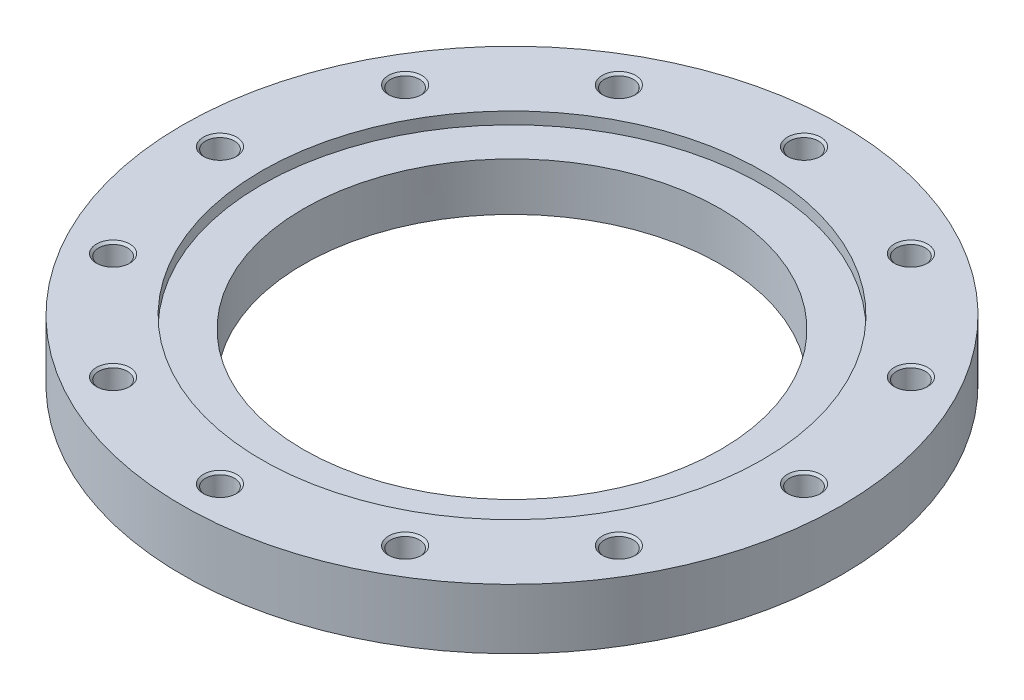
ISO-10303-21;
HEADER;
FILE_DESCRIPTION(('STEP AP214'),'2;1');
FILE_NAME('part.step','',(''),(''),'','','');
FILE_SCHEMA(('AUTOMOTIVE_DESIGN { 1 0 10303 214 1 1 1 1 }'));
ENDSEC;
DATA;
#1=APPLICATION_CONTEXT('core data for automotive mechanical design processes');
#2=APPLICATION_PROTOCOL_DEFINITION('international standard','automotive_design',2000,#1);
#3=PRODUCT_CONTEXT('',#1,'mechanical');
#4=PRODUCT('Part','Part','',(#3));
#5=PRODUCT_RELATED_PRODUCT_CATEGORY('part','',(#4));
#6=PRODUCT_DEFINITION_FORMATION('','',#4);
#7=PRODUCT_DEFINITION_CONTEXT('part definition',#1,'design');
#8=PRODUCT_DEFINITION('design','',#6,#7);
#9=PRODUCT_DEFINITION_SHAPE('','',#8);
#10=(LENGTH_UNIT() NAMED_UNIT(*) SI_UNIT(.MILLI.,.METRE.));
#11=(NAMED_UNIT(*) PLANE_ANGLE_UNIT() SI_UNIT($,.RADIAN.));
#12=(NAMED_UNIT(*) SI_UNIT($,.STERADIAN.) SOLID_ANGLE_UNIT());
#13=UNCERTAINTY_MEASURE_WITH_UNIT(LENGTH_MEASURE(1.E-05),#10,'distance_accuracy_value','');
#14=(GEOMETRIC_REPRESENTATION_CONTEXT(3) GLOBAL_UNCERTAINTY_ASSIGNED_CONTEXT((#13)) GLOBAL_UNIT_ASSIGNED_CONTEXT((#10,
#11,#12)) REPRESENTATION_CONTEXT('',''));
#15=CARTESIAN_POINT('',(0.,0.,0.));
#16=DIRECTION('',(0.,0.,1.));
#17=DIRECTION('',(1.,0.,0.));
#18=AXIS2_PLACEMENT_3D('',#15,#16,#17);
#19=CARTESIAN_POINT('',(0.,18.,0.));
#20=DIRECTION('',(0.,-1.,0.));
#21=DIRECTION('',(1.,0.,0.));
#22=AXIS2_PLACEMENT_3D('',#19,#20,#21);
#23=CYLINDRICAL_SURFACE('',#22,197.5);
#24=CARTESIAN_POINT('',(0.,0.,0.));
#25=DIRECTION('',(0.,1.,0.));
#26=DIRECTION('',(1.,0.,0.));
#27=AXIS2_PLACEMENT_3D('',#24,#25,#26);
#28=CIRCLE('',#27,197.5);
#29=CARTESIAN_POINT('',(197.5,0.,0.));
#30=VERTEX_POINT('',#29);
#31=EDGE_CURVE('E9',#30,#30,#28,.T.);
#32=ORIENTED_EDGE('',*,*,#31,.T.);
#33=EDGE_LOOP('',(#32));
#34=FACE_BOUND('',#33,.T.);
#35=CARTESIAN_POINT('',(0.,36.,0.));
#36=DIRECTION('',(0.,1.,0.));
#37=DIRECTION('',(1.,0.,0.));
#38=AXIS2_PLACEMENT_3D('',#35,#36,#37);
#39=CIRCLE('',#38,197.5);
#40=CARTESIAN_POINT('',(197.5,36.,0.));
#41=VERTEX_POINT('',#40);
#42=EDGE_CURVE('E236',#41,#41,#39,.T.);
#43=ORIENTED_EDGE('',*,*,#42,.F.);
#44=EDGE_LOOP('',(#43));
#45=FACE_BOUND('',#44,.T.);
#46=ADVANCED_FACE('F15',(#34,#45),#23,.T.);
#47=CARTESIAN_POINT('',(161.25,0.,0.));
#48=DIRECTION('',(0.,-1.,0.));
#49=DIRECTION('',(-1.,0.,0.));
#50=AXIS2_PLACEMENT_3D('',#47,#48,#49);
#51=PLANE('',#50);
#52=CARTESIAN_POINT('',(0.,0.,0.));
#53=DIRECTION('',(0.,1.,0.));
#54=DIRECTION('',(1.,0.,0.));
#55=AXIS2_PLACEMENT_3D('',#52,#53,#54);
#56=CIRCLE('',#55,125.);
#57=CARTESIAN_POINT('',(125.,0.,0.));
#58=VERTEX_POINT('',#57);
#59=EDGE_CURVE('E23',#58,#58,#56,.T.);
#60=ORIENTED_EDGE('',*,*,#59,.T.);
#61=EDGE_LOOP('',(#60));
#62=FACE_BOUND('',#61,.T.);
#63=ORIENTED_EDGE('',*,*,#31,.F.);
#64=EDGE_LOOP('',(#63));
#65=FACE_BOUND('',#64,.T.);
#66=ADVANCED_FACE('F239',(#62,#65),#51,.T.);
#67=CARTESIAN_POINT('',(0.,18.,0.));
#68=DIRECTION('',(0.,-1.,0.));
#69=DIRECTION('',(1.,0.,0.));
#70=AXIS2_PLACEMENT_3D('',#67,#68,#69);
#71=CYLINDRICAL_SURFACE('',#70,125.);
#72=ORIENTED_EDGE('',*,*,#59,.F.);
#73=EDGE_LOOP('',(#72));
#74=FACE_BOUND('',#73,.T.);
#75=CARTESIAN_POINT('',(0.,28.8,0.));
#76=DIRECTION('',(0.,1.,0.));
#77=DIRECTION('',(1.,0.,0.));
#78=AXIS2_PLACEMENT_3D('',#75,#76,#77);
#79=CIRCLE('',#78,125.);
#80=CARTESIAN_POINT('',(-125.,28.8,0.));
#81=VERTEX_POINT('',#80);
#82=EDGE_CURVE('E233',#81,#81,#79,.T.);
#83=ORIENTED_EDGE('',*,*,#82,.T.);
#84=EDGE_LOOP('',(#83));
#85=FACE_BOUND('',#84,.T.);
#86=ADVANCED_FACE('F242',(#74,#85),#71,.F.);
#87=CARTESIAN_POINT('',(161.25,36.,0.));
#88=DIRECTION('',(0.,1.,0.));
#89=DIRECTION('',(1.,0.,0.));
#90=AXIS2_PLACEMENT_3D('',#87,#88,#89);
#91=PLANE('',#90);
#92=ORIENTED_EDGE('',*,*,#42,.T.);
#93=EDGE_LOOP('',(#92));
#94=FACE_BOUND('',#93,.T.);
#95=CARTESIAN_POINT('',(0.,36.,0.));
#96=DIRECTION('',(0.,-1.,0.));
#97=DIRECTION('',(1.,0.,0.));
#98=AXIS2_PLACEMENT_3D('',#95,#96,#97);
#99=CIRCLE('',#98,150.);
#100=CARTESIAN_POINT('',(-150.,36.,0.));
#101=VERTEX_POINT('',#100);
#102=EDGE_CURVE('E224',#101,#101,#99,.T.);
#103=ORIENTED_EDGE('',*,*,#102,.T.);
#104=EDGE_LOOP('',(#103));
#105=FACE_BOUND('',#104,.T.);
#106=CARTESIAN_POINT('',(175.,36.,0.));
#107=DIRECTION('',(0.,-1.,0.));
#108=DIRECTION('',(1.,0.,0.));
#109=AXIS2_PLACEMENT_3D('',#106,#107,#108);
#110=CIRCLE('',#109,10.);
#111=CARTESIAN_POINT('',(185.,36.,0.));
#112=VERTEX_POINT('',#111);
#113=EDGE_CURVE('E277',#112,#112,#110,.T.);
#114=ORIENTED_EDGE('',*,*,#113,.T.);
#115=EDGE_LOOP('',(#114));
#116=FACE_BOUND('',#115,.T.);
#117=CARTESIAN_POINT('',(151.554445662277,36.,-87.5));
#118=DIRECTION('',(0.,-1.,0.));
#119=DIRECTION('',(0.866025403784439,0.,-0.5));
#120=AXIS2_PLACEMENT_3D('',#117,#118,#119);
#121=CIRCLE('',#120,10.);
#122=CARTESIAN_POINT('',(160.214699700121,36.,-92.5));
#123=VERTEX_POINT('',#122);
#124=EDGE_CURVE('E281',#123,#123,#121,.T.);
#125=ORIENTED_EDGE('',*,*,#124,.T.);
#126=EDGE_LOOP('',(#125));
#127=FACE_BOUND('',#126,.T.);
#128=CARTESIAN_POINT('',(87.5,36.,-151.554445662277));
#129=DIRECTION('',(0.,-1.,0.));
#130=DIRECTION('',(0.5,0.,-0.866025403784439));
#131=AXIS2_PLACEMENT_3D('',#128,#129,#130);
#132=CIRCLE('',#131,10.);
#133=CARTESIAN_POINT('',(92.5,36.,-160.214699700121));
#134=VERTEX_POINT('',#133);
#135=EDGE_CURVE('E284',#134,#134,#132,.T.);
#136=ORIENTED_EDGE('',*,*,#135,.T.);
#137=EDGE_LOOP('',(#136));
#138=FACE_BOUND('',#137,.T.);
#139=CARTESIAN_POINT('',(0.,36.,-175.));
#140=DIRECTION('',(0.,-1.,0.));
#141=DIRECTION('',(0.,0.,-1.));
#142=AXIS2_PLACEMENT_3D('',#139,#140,#141);
#143=CIRCLE('',#142,10.);
#144=CARTESIAN_POINT('',(0.,36.,-185.));
#145=VERTEX_POINT('',#144);
#146=EDGE_CURVE('E288',#145,#145,#143,.T.);
#147=ORIENTED_EDGE('',*,*,#146,.T.);
#148=EDGE_LOOP('',(#147));
#149=FACE_BOUND('',#148,.T.);
#150=CARTESIAN_POINT('',(-87.5,36.,-151.554445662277));
#151=DIRECTION('',(0.,-1.,0.));
#152=DIRECTION('',(-0.5,0.,-0.866025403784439));
#153=AXIS2_PLACEMENT_3D('',#150,#151,#152);
#154=CIRCLE('',#153,10.);
#155=CARTESIAN_POINT('',(-92.5,36.,-160.214699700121));
#156=VERTEX_POINT('',#155);
#157=EDGE_CURVE('E291',#156,#156,#154,.T.);
#158=ORIENTED_EDGE('',*,*,#157,.T.);
#159=EDGE_LOOP('',(#158));
#160=FACE_BOUND('',#159,.T.);
#161=CARTESIAN_POINT('',(-151.554445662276,36.,-87.5));
#162=DIRECTION('',(0.,-1.,0.));
#163=DIRECTION('',(-0.866025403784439,0.,-0.5));
#164=AXIS2_PLACEMENT_3D('',#161,#162,#163);
#165=CIRCLE('',#164,10.);
#166=CARTESIAN_POINT('',(-160.214699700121,36.,-92.5));
#167=VERTEX_POINT('',#166);
#168=EDGE_CURVE('E294',#167,#167,#165,.T.);
#169=ORIENTED_EDGE('',*,*,#168,.T.);
#170=EDGE_LOOP('',(#169));
#171=FACE_BOUND('',#170,.T.);
#172=CARTESIAN_POINT('',(-175.,36.,0.));
#173=DIRECTION('',(0.,-1.,0.));
#174=DIRECTION('',(-1.,0.,0.));
#175=AXIS2_PLACEMENT_3D('',#172,#173,#174);
#176=CIRCLE('',#175,10.);
#177=CARTESIAN_POINT('',(-185.,36.,0.));
#178=VERTEX_POINT('',#177);
#179=EDGE_CURVE('E297',#178,#178,#176,.T.);
#180=ORIENTED_EDGE('',*,*,#179,.T.);
#181=EDGE_LOOP('',(#180));
#182=FACE_BOUND('',#181,.T.);
#183=CARTESIAN_POINT('',(-151.554445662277,36.,87.5));
#184=DIRECTION('',(0.,-1.,0.));
#185=DIRECTION('',(-0.866025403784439,0.,0.5));
#186=AXIS2_PLACEMENT_3D('',#183,#184,#185);
#187=CIRCLE('',#186,10.);
#188=CARTESIAN_POINT('',(-160.214699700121,36.,92.5));
#189=VERTEX_POINT('',#188);
#190=EDGE_CURVE('E300',#189,#189,#187,.T.);
#191=ORIENTED_EDGE('',*,*,#190,.T.);
#192=EDGE_LOOP('',(#191));
#193=FACE_BOUND('',#192,.T.);
#194=CARTESIAN_POINT('',(-87.5,36.,151.554445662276));
#195=DIRECTION('',(0.,-1.,0.));
#196=DIRECTION('',(-0.5,0.,0.866025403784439));
#197=AXIS2_PLACEMENT_3D('',#194,#195,#196);
#198=CIRCLE('',#197,10.);
#199=CARTESIAN_POINT('',(-92.5,36.,160.214699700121));
#200=VERTEX_POINT('',#199);
#201=EDGE_CURVE('E303',#200,#200,#198,.T.);
#202=ORIENTED_EDGE('',*,*,#201,.T.);
#203=EDGE_LOOP('',(#202));
#204=FACE_BOUND('',#203,.T.);
#205=CARTESIAN_POINT('',(0.,36.,175.));
#206=DIRECTION('',(0.,-1.,0.));
#207=DIRECTION('',(0.,0.,1.));
#208=AXIS2_PLACEMENT_3D('',#205,#206,#207);
#209=CIRCLE('',#208,10.);
#210=CARTESIAN_POINT('',(0.,36.,185.));
#211=VERTEX_POINT('',#210);
#212=EDGE_CURVE('E308',#211,#211,#209,.T.);
#213=ORIENTED_EDGE('',*,*,#212,.T.);
#214=EDGE_LOOP('',(#213));
#215=FACE_BOUND('',#214,.T.);
#216=CARTESIAN_POINT('',(87.5,36.,151.554445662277));
#217=DIRECTION('',(0.,-1.,0.));
#218=DIRECTION('',(0.5,0.,0.866025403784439));
#219=AXIS2_PLACEMENT_3D('',#216,#217,#218);
#220=CIRCLE('',#219,10.);
#221=CARTESIAN_POINT('',(92.5,36.,160.214699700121));
#222=VERTEX_POINT('',#221);
#223=EDGE_CURVE('E313',#222,#222,#220,.T.);
#224=ORIENTED_EDGE('',*,*,#223,.T.);
#225=EDGE_LOOP('',(#224));
#226=FACE_BOUND('',#225,.T.);
#227=CARTESIAN_POINT('',(151.554445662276,36.,87.5));
#228=DIRECTION('',(0.,-1.,0.));
#229=DIRECTION('',(0.866025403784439,0.,0.5));
#230=AXIS2_PLACEMENT_3D('',#227,#228,#229);
#231=CIRCLE('',#230,10.);
#232=CARTESIAN_POINT('',(160.214699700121,36.,92.5));
#233=VERTEX_POINT('',#232);
#234=EDGE_CURVE('E317',#233,#233,#231,.T.);
#235=ORIENTED_EDGE('',*,*,#234,.T.);
#236=EDGE_LOOP('',(#235));
#237=FACE_BOUND('',#236,.T.);
#238=ADVANCED_FACE('F245',(#94,#105,#116,#127,#138,#149,#160,#171,#182,#193,#204,#215,#226,
#237),#91,.T.);
#239=CARTESIAN_POINT('',(0.,28.8,0.));
#240=DIRECTION('',(0.,-1.,0.));
#241=DIRECTION('',(-1.,0.,0.));
#242=AXIS2_PLACEMENT_3D('',#239,#240,#241);
#243=PLANE('',#242);
#244=CARTESIAN_POINT('',(0.,28.8,0.));
#245=DIRECTION('',(0.,-1.,0.));
#246=DIRECTION('',(1.,0.,0.));
#247=AXIS2_PLACEMENT_3D('',#244,#245,#246);
#248=CIRCLE('',#247,150.);
#249=CARTESIAN_POINT('',(150.,28.8,0.));
#250=VERTEX_POINT('',#249);
#251=EDGE_CURVE('E226',#250,#250,#248,.T.);
#252=ORIENTED_EDGE('',*,*,#251,.F.);
#253=EDGE_LOOP('',(#252));
#254=FACE_BOUND('',#253,.T.);
#255=ORIENTED_EDGE('',*,*,#82,.F.);
#256=EDGE_LOOP('',(#255));
#257=FACE_BOUND('',#256,.T.);
#258=ADVANCED_FACE('F250',(#254,#257),#243,.F.);
#259=CARTESIAN_POINT('',(0.,34.2,0.));
#260=DIRECTION('',(0.,-1.,0.));
#261=DIRECTION('',(1.,0.,0.));
#262=AXIS2_PLACEMENT_3D('',#259,#260,#261);
#263=CYLINDRICAL_SURFACE('',#262,150.);
#264=ORIENTED_EDGE('',*,*,#251,.T.);
#265=EDGE_LOOP('',(#264));
#266=FACE_BOUND('',#265,.T.);
#267=ORIENTED_EDGE('',*,*,#102,.F.);
#268=EDGE_LOOP('',(#267));
#269=FACE_BOUND('',#268,.T.);
#270=ADVANCED_FACE('F252',(#266,#269),#263,.F.);
#271=CARTESIAN_POINT('',(175.,5.50386219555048,0.));
#272=DIRECTION('',(0.,1.,0.));
#273=DIRECTION('',(1.,0.,0.));
#274=AXIS2_PLACEMENT_3D('',#271,#272,#273);
#275=CONICAL_SURFACE('',#274,4.3234375,1.0471975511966);
#276=CARTESIAN_POINT('',(175.,8.,0.));
#277=DIRECTION('',(0.,-1.,0.));
#278=DIRECTION('',(1.,0.,0.));
#279=AXIS2_PLACEMENT_3D('',#276,#277,#278);
#280=CIRCLE('',#279,8.646875);
#281=CARTESIAN_POINT('',(183.646875,8.,0.));
#282=VERTEX_POINT('',#281);
#283=EDGE_CURVE('E221',#282,#282,#280,.T.);
#284=ORIENTED_EDGE('',*,*,#283,.F.);
#285=EDGE_LOOP('',(#284));
#286=FACE_BOUND('',#285,.T.);
#287=CARTESIAN_POINT('',(175.,3.00772439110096,0.));
#288=VERTEX_POINT('',#287);
#289=VERTEX_LOOP('',#288);
#290=FACE_BOUND('',#289,.T.);
#291=ADVANCED_FACE('F260',(#286,#290),#275,.F.);
#292=CARTESIAN_POINT('',(175.,11.3234375,0.));
#293=DIRECTION('',(0.,1.,0.));
#294=DIRECTION('',(1.,0.,0.));
#295=AXIS2_PLACEMENT_3D('',#292,#293,#294);
#296=CYLINDRICAL_SURFACE('',#295,8.646875);
#297=CARTESIAN_POINT('',(175.,14.646875,0.));
#298=DIRECTION('',(0.,-1.,0.));
#299=DIRECTION('',(1.,0.,0.));
#300=AXIS2_PLACEMENT_3D('',#297,#298,#299);
#301=CIRCLE('',#300,8.646875);
#302=CARTESIAN_POINT('',(183.646875,14.646875,0.));
#303=VERTEX_POINT('',#302);
#304=EDGE_CURVE('E217',#303,#303,#301,.T.);
#305=ORIENTED_EDGE('',*,*,#304,.F.);
#306=EDGE_LOOP('',(#305));
#307=FACE_BOUND('',#306,.T.);
#308=ORIENTED_EDGE('',*,*,#283,.T.);
#309=EDGE_LOOP('',(#308));
#310=FACE_BOUND('',#309,.T.);
#311=ADVANCED_FACE('F222',(#307,#310),#296,.F.);
#312=CARTESIAN_POINT('',(175.,15.3234375,0.));
#313=DIRECTION('',(0.,1.,0.));
#314=DIRECTION('',(1.,0.,0.));
#315=AXIS2_PLACEMENT_3D('',#312,#313,#314);
#316=CONICAL_SURFACE('',#315,9.3234375,0.785398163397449);
#317=CARTESIAN_POINT('',(175.,16.,0.));
#318=DIRECTION('',(0.,-1.,0.));
#319=DIRECTION('',(1.,0.,0.));
#320=AXIS2_PLACEMENT_3D('',#317,#318,#319);
#321=CIRCLE('',#320,10.);
#322=CARTESIAN_POINT('',(185.,16.,0.));
#323=VERTEX_POINT('',#322);
#324=EDGE_CURVE('E228',#323,#323,#321,.T.);
#325=ORIENTED_EDGE('',*,*,#324,.F.);
#326=EDGE_LOOP('',(#325));
#327=FACE_BOUND('',#326,.T.);
#328=ORIENTED_EDGE('',*,*,#304,.T.);
#329=EDGE_LOOP('',(#328));
#330=FACE_BOUND('',#329,.T.);
#331=ADVANCED_FACE('F468',(#327,#330),#316,.F.);
#332=CARTESIAN_POINT('',(184.3234375,16.,0.));
#333=DIRECTION('',(0.,1.,0.));
#334=DIRECTION('',(-1.,0.,0.));
#335=AXIS2_PLACEMENT_3D('',#332,#333,#334);
#336=PLANE('',#335);
#337=CARTESIAN_POINT('',(175.,16.,0.));
#338=DIRECTION('',(0.,-1.,0.));
#339=DIRECTION('',(1.,0.,0.));
#340=AXIS2_PLACEMENT_3D('',#337,#338,#339);
#341=CIRCLE('',#340,8.646875);
#342=CARTESIAN_POINT('',(183.646875,16.,0.));
#343=VERTEX_POINT('',#342);
#344=EDGE_CURVE('E463',#343,#343,#341,.T.);
#345=ORIENTED_EDGE('',*,*,#344,.F.);
#346=EDGE_LOOP('',(#345));
#347=FACE_BOUND('',#346,.T.);
#348=ORIENTED_EDGE('',*,*,#324,.T.);
#349=EDGE_LOOP('',(#348));
#350=FACE_BOUND('',#349,.T.);
#351=ADVANCED_FACE('F466',(#347,#350),#336,.F.);
#352=CARTESIAN_POINT('',(175.,25.3234375,0.));
#353=DIRECTION('',(0.,1.,0.));
#354=DIRECTION('',(1.,0.,0.));
#355=AXIS2_PLACEMENT_3D('',#352,#353,#354);
#356=CYLINDRICAL_SURFACE('',#355,8.646875);
#357=CARTESIAN_POINT('',(175.,34.646875,0.));
#358=DIRECTION('',(0.,-1.,0.));
#359=DIRECTION('',(1.,0.,0.));
#360=AXIS2_PLACEMENT_3D('',#357,#358,#359);
#361=CIRCLE('',#360,8.646875);
#362=CARTESIAN_POINT('',(183.646875,34.646875,0.));
#363=VERTEX_POINT('',#362);
#364=EDGE_CURVE('E460',#363,#363,#361,.T.);
#365=ORIENTED_EDGE('',*,*,#364,.F.);
#366=EDGE_LOOP('',(#365));
#367=FACE_BOUND('',#366,.T.);
#368=ORIENTED_EDGE('',*,*,#344,.T.);
#369=EDGE_LOOP('',(#368));
#370=FACE_BOUND('',#369,.T.);
#371=ADVANCED_FACE('F475',(#367,#370),#356,.F.);
#372=CARTESIAN_POINT('',(175.,35.3234375,0.));
#373=DIRECTION('',(0.,1.,0.));
#374=DIRECTION('',(1.,0.,0.));
#375=AXIS2_PLACEMENT_3D('',#372,#373,#374);
#376=CONICAL_SURFACE('',#375,9.3234375,0.785398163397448);
#377=ORIENTED_EDGE('',*,*,#113,.F.);
#378=EDGE_LOOP('',(#377));
#379=FACE_BOUND('',#378,.T.);
#380=ORIENTED_EDGE('',*,*,#364,.T.);
#381=EDGE_LOOP('',(#380));
#382=FACE_BOUND('',#381,.T.);
#383=ADVANCED_FACE('F562',(#379,#382),#376,.F.);
#384=CARTESIAN_POINT('',(151.554445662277,5.50386219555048,-87.5));
#385=DIRECTION('',(0.,1.,0.));
#386=DIRECTION('',(0.866025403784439,0.,-0.5));
#387=AXIS2_PLACEMENT_3D('',#384,#385,#386);
#388=CONICAL_SURFACE('',#387,4.3234375,1.0471975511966);
#389=CARTESIAN_POINT('',(151.554445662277,8.,-87.5));
#390=DIRECTION('',(0.,-1.,0.));
#391=DIRECTION('',(0.866025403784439,0.,-0.5));
#392=AXIS2_PLACEMENT_3D('',#389,#390,#391);
#393=CIRCLE('',#392,8.646875);
#394=CARTESIAN_POINT('',(159.042859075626,8.,-91.8234375));
#395=VERTEX_POINT('',#394);
#396=EDGE_CURVE('E458',#395,#395,#393,.T.);
#397=ORIENTED_EDGE('',*,*,#396,.F.);
#398=EDGE_LOOP('',(#397));
#399=FACE_BOUND('',#398,.T.);
#400=CARTESIAN_POINT('',(151.554445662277,3.00772439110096,-87.5));
#401=VERTEX_POINT('',#400);
#402=VERTEX_LOOP('',#401);
#403=FACE_BOUND('',#402,.T.);
#404=ADVANCED_FACE('F556',(#399,#403),#388,.F.);
#405=CARTESIAN_POINT('',(151.554445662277,11.3234375,-87.5));
#406=DIRECTION('',(0.,1.,0.));
#407=DIRECTION('',(0.866025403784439,0.,-0.5));
#408=AXIS2_PLACEMENT_3D('',#405,#406,#407);
#409=CYLINDRICAL_SURFACE('',#408,8.646875);
#410=CARTESIAN_POINT('',(151.554445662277,14.646875,-87.5));
#411=DIRECTION('',(0.,-1.,0.));
#412=DIRECTION('',(0.866025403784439,0.,-0.5));
#413=AXIS2_PLACEMENT_3D('',#410,#411,#412);
#414=CIRCLE('',#413,8.646875);
#415=CARTESIAN_POINT('',(159.042859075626,14.646875,-91.8234375));
#416=VERTEX_POINT('',#415);
#417=EDGE_CURVE('E456',#416,#416,#414,.T.);
#418=ORIENTED_EDGE('',*,*,#417,.F.);
#419=EDGE_LOOP('',(#418));
#420=FACE_BOUND('',#419,.T.);
#421=ORIENTED_EDGE('',*,*,#396,.T.);
#422=EDGE_LOOP('',(#421));
#423=FACE_BOUND('',#422,.T.);
#424=ADVANCED_FACE('F550',(#420,#423),#409,.F.);
#425=CARTESIAN_POINT('',(151.554445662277,15.3234375,-87.5));
#426=DIRECTION('',(0.,1.,0.));
#427=DIRECTION('',(0.866025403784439,0.,-0.5));
#428=AXIS2_PLACEMENT_3D('',#425,#426,#427);
#429=CONICAL_SURFACE('',#428,9.3234375,0.785398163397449);
#430=CARTESIAN_POINT('',(151.554445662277,16.,-87.5));
#431=DIRECTION('',(0.,-1.,0.));
#432=DIRECTION('',(0.866025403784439,0.,-0.5));
#433=AXIS2_PLACEMENT_3D('',#430,#431,#432);
#434=CIRCLE('',#433,10.);
#435=CARTESIAN_POINT('',(160.214699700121,16.,-92.5));
#436=VERTEX_POINT('',#435);
#437=EDGE_CURVE('E454',#436,#436,#434,.T.);
#438=ORIENTED_EDGE('',*,*,#437,.F.);
#439=EDGE_LOOP('',(#438));
#440=FACE_BOUND('',#439,.T.);
#441=ORIENTED_EDGE('',*,*,#417,.T.);
#442=EDGE_LOOP('',(#441));
#443=FACE_BOUND('',#442,.T.);
#444=ADVANCED_FACE('F544',(#440,#443),#429,.F.);
#445=CARTESIAN_POINT('',(159.628779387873,16.,-92.16171875));
#446=DIRECTION('',(0.,1.,0.));
#447=DIRECTION('',(-0.866025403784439,0.,0.5));
#448=AXIS2_PLACEMENT_3D('',#445,#446,#447);
#449=PLANE('',#448);
#450=CARTESIAN_POINT('',(151.554445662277,16.,-87.5));
#451=DIRECTION('',(0.,-1.,0.));
#452=DIRECTION('',(0.866025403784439,0.,-0.5));
#453=AXIS2_PLACEMENT_3D('',#450,#451,#452);
#454=CIRCLE('',#453,8.646875);
#455=CARTESIAN_POINT('',(159.042859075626,16.,-91.8234375));
#456=VERTEX_POINT('',#455);
#457=EDGE_CURVE('E396',#456,#456,#454,.T.);
#458=ORIENTED_EDGE('',*,*,#457,.F.);
#459=EDGE_LOOP('',(#458));
#460=FACE_BOUND('',#459,.T.);
#461=ORIENTED_EDGE('',*,*,#437,.T.);
#462=EDGE_LOOP('',(#461));
#463=FACE_BOUND('',#462,.T.);
#464=ADVANCED_FACE('F538',(#460,#463),#449,.F.);
#465=CARTESIAN_POINT('',(151.554445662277,25.3234375,-87.5));
#466=DIRECTION('',(0.,1.,0.));
#467=DIRECTION('',(0.866025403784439,0.,-0.5));
#468=AXIS2_PLACEMENT_3D('',#465,#466,#467);
#469=CYLINDRICAL_SURFACE('',#468,8.646875);
#470=CARTESIAN_POINT('',(151.554445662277,34.646875,-87.5));
#471=DIRECTION('',(0.,-1.,0.));
#472=DIRECTION('',(0.866025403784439,0.,-0.5));
#473=AXIS2_PLACEMENT_3D('',#470,#471,#472);
#474=CIRCLE('',#473,8.646875);
#475=CARTESIAN_POINT('',(159.042859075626,34.646875,-91.8234375));
#476=VERTEX_POINT('',#475);
#477=EDGE_CURVE('E397',#476,#476,#474,.T.);
#478=ORIENTED_EDGE('',*,*,#477,.F.);
#479=EDGE_LOOP('',(#478));
#480=FACE_BOUND('',#479,.T.);
#481=ORIENTED_EDGE('',*,*,#457,.T.);
#482=EDGE_LOOP('',(#481));
#483=FACE_BOUND('',#482,.T.);
#484=ADVANCED_FACE('F535',(#480,#483),#469,.F.);
#485=CARTESIAN_POINT('',(151.554445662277,35.3234375,-87.5));
#486=DIRECTION('',(0.,1.,0.));
#487=DIRECTION('',(0.866025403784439,0.,-0.5));
#488=AXIS2_PLACEMENT_3D('',#485,#486,#487);
#489=CONICAL_SURFACE('',#488,9.3234375,0.785398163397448);
#490=ORIENTED_EDGE('',*,*,#124,.F.);
#491=EDGE_LOOP('',(#490));
#492=FACE_BOUND('',#491,.T.);
#493=ORIENTED_EDGE('',*,*,#477,.T.);
#494=EDGE_LOOP('',(#493));
#495=FACE_BOUND('',#494,.T.);
#496=ADVANCED_FACE('F533',(#492,#495),#489,.F.);
#497=CARTESIAN_POINT('',(87.5,5.50386219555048,-151.554445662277));
#498=DIRECTION('',(0.,1.,0.));
#499=DIRECTION('',(0.5,0.,-0.866025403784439));
#500=AXIS2_PLACEMENT_3D('',#497,#498,#499);
#501=CONICAL_SURFACE('',#500,4.3234375,1.0471975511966);
#502=CARTESIAN_POINT('',(87.5,8.,-151.554445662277));
#503=DIRECTION('',(0.,-1.,0.));
#504=DIRECTION('',(0.5,0.,-0.866025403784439));
#505=AXIS2_PLACEMENT_3D('',#502,#503,#504);
#506=CIRCLE('',#505,8.646875);
#507=CARTESIAN_POINT('',(91.8234375,8.,-159.042859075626));
#508=VERTEX_POINT('',#507);
#509=EDGE_CURVE('E449',#508,#508,#506,.T.);
#510=ORIENTED_EDGE('',*,*,#509,.F.);
#511=EDGE_LOOP('',(#510));
#512=FACE_BOUND('',#511,.T.);
#513=CARTESIAN_POINT('',(87.5,3.00772439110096,-151.554445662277));
#514=VERTEX_POINT('',#513);
#515=VERTEX_LOOP('',#514);
#516=FACE_BOUND('',#515,.T.);
#517=ADVANCED_FACE('F625',(#512,#516),#501,.F.);
#518=CARTESIAN_POINT('',(87.5,11.3234375,-151.554445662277));
#519=DIRECTION('',(0.,1.,0.));
#520=DIRECTION('',(0.5,0.,-0.866025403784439));
#521=AXIS2_PLACEMENT_3D('',#518,#519,#520);
#522=CYLINDRICAL_SURFACE('',#521,8.646875);
#523=CARTESIAN_POINT('',(87.5,14.646875,-151.554445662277));
#524=DIRECTION('',(0.,-1.,0.));
#525=DIRECTION('',(0.5,0.,-0.866025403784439));
#526=AXIS2_PLACEMENT_3D('',#523,#524,#525);
#527=CIRCLE('',#526,8.646875);
#528=CARTESIAN_POINT('',(91.8234375,14.646875,-159.042859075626));
#529=VERTEX_POINT('',#528);
#530=EDGE_CURVE('E381',#529,#529,#527,.T.);
#531=ORIENTED_EDGE('',*,*,#530,.F.);
#532=EDGE_LOOP('',(#531));
#533=FACE_BOUND('',#532,.T.);
#534=ORIENTED_EDGE('',*,*,#509,.T.);
#535=EDGE_LOOP('',(#534));
#536=FACE_BOUND('',#535,.T.);
#537=ADVANCED_FACE('F635',(#533,#536),#522,.F.);
#538=CARTESIAN_POINT('',(87.5,15.3234375,-151.554445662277));
#539=DIRECTION('',(0.,1.,0.));
#540=DIRECTION('',(0.5,0.,-0.866025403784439));
#541=AXIS2_PLACEMENT_3D('',#538,#539,#540);
#542=CONICAL_SURFACE('',#541,9.3234375,0.785398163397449);
#543=CARTESIAN_POINT('',(87.5,16.,-151.554445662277));
#544=DIRECTION('',(0.,-1.,0.));
#545=DIRECTION('',(0.5,0.,-0.866025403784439));
#546=AXIS2_PLACEMENT_3D('',#543,#544,#545);
#547=CIRCLE('',#546,10.);
#548=CARTESIAN_POINT('',(92.5,16.,-160.214699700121));
#549=VERTEX_POINT('',#548);
#550=EDGE_CURVE('E379',#549,#549,#547,.T.);
#551=ORIENTED_EDGE('',*,*,#550,.F.);
#552=EDGE_LOOP('',(#551));
#553=FACE_BOUND('',#552,.T.);
#554=ORIENTED_EDGE('',*,*,#530,.T.);
#555=EDGE_LOOP('',(#554));
#556=FACE_BOUND('',#555,.T.);
#557=ADVANCED_FACE('F645',(#553,#556),#542,.F.);
#558=CARTESIAN_POINT('',(92.16171875,16.,-159.628779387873));
#559=DIRECTION('',(0.,1.,0.));
#560=DIRECTION('',(-0.5,0.,0.866025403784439));
#561=AXIS2_PLACEMENT_3D('',#558,#559,#560);
#562=PLANE('',#561);
#563=CARTESIAN_POINT('',(87.5,16.,-151.554445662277));
#564=DIRECTION('',(0.,-1.,0.));
#565=DIRECTION('',(0.5,0.,-0.866025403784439));
#566=AXIS2_PLACEMENT_3D('',#563,#564,#565);
#567=CIRCLE('',#566,8.646875);
#568=CARTESIAN_POINT('',(91.8234375,16.,-159.042859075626));
#569=VERTEX_POINT('',#568);
#570=EDGE_CURVE('E382',#569,#569,#567,.T.);
#571=ORIENTED_EDGE('',*,*,#570,.F.);
#572=EDGE_LOOP('',(#571));
#573=FACE_BOUND('',#572,.T.);
#574=ORIENTED_EDGE('',*,*,#550,.T.);
#575=EDGE_LOOP('',(#574));
#576=FACE_BOUND('',#575,.T.);
#577=ADVANCED_FACE('F655',(#573,#576),#562,.F.);
#578=CARTESIAN_POINT('',(87.5,25.3234375,-151.554445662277));
#579=DIRECTION('',(0.,1.,0.));
#580=DIRECTION('',(0.5,0.,-0.866025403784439));
#581=AXIS2_PLACEMENT_3D('',#578,#579,#580);
#582=CYLINDRICAL_SURFACE('',#581,8.646875);
#583=CARTESIAN_POINT('',(87.5,34.646875,-151.554445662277));
#584=DIRECTION('',(0.,-1.,0.));
#585=DIRECTION('',(0.5,0.,-0.866025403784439));
#586=AXIS2_PLACEMENT_3D('',#583,#584,#585);
#587=CIRCLE('',#586,8.646875);
#588=CARTESIAN_POINT('',(91.8234375,34.646875,-159.042859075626));
#589=VERTEX_POINT('',#588);
#590=EDGE_CURVE('E443',#589,#589,#587,.T.);
#591=ORIENTED_EDGE('',*,*,#590,.F.);
#592=EDGE_LOOP('',(#591));
#593=FACE_BOUND('',#592,.T.);
#594=ORIENTED_EDGE('',*,*,#570,.T.);
#595=EDGE_LOOP('',(#594));
#596=FACE_BOUND('',#595,.T.);
#597=ADVANCED_FACE('F665',(#593,#596),#582,.F.);
#598=CARTESIAN_POINT('',(87.5,35.3234375,-151.554445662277));
#599=DIRECTION('',(0.,1.,0.));
#600=DIRECTION('',(0.5,0.,-0.866025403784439));
#601=AXIS2_PLACEMENT_3D('',#598,#599,#600);
#602=CONICAL_SURFACE('',#601,9.3234375,0.785398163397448);
#603=ORIENTED_EDGE('',*,*,#135,.F.);
#604=EDGE_LOOP('',(#603));
#605=FACE_BOUND('',#604,.T.);
#606=ORIENTED_EDGE('',*,*,#590,.T.);
#607=EDGE_LOOP('',(#606));
#608=FACE_BOUND('',#607,.T.);
#609=ADVANCED_FACE('F675',(#605,#608),#602,.F.);
#610=CARTESIAN_POINT('',(0.,5.50386219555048,-175.));
#611=DIRECTION('',(0.,1.,0.));
#612=DIRECTION('',(0.,0.,-1.));
#613=AXIS2_PLACEMENT_3D('',#610,#611,#612);
#614=CONICAL_SURFACE('',#613,4.3234375,1.0471975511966);
#615=CARTESIAN_POINT('',(0.,8.,-175.));
#616=DIRECTION('',(0.,-1.,0.));
#617=DIRECTION('',(0.,0.,-1.));
#618=AXIS2_PLACEMENT_3D('',#615,#616,#617);
#619=CIRCLE('',#618,8.646875);
#620=CARTESIAN_POINT('',(0.,8.,-183.646875));
#621=VERTEX_POINT('',#620);
#622=EDGE_CURVE('E441',#621,#621,#619,.T.);
#623=ORIENTED_EDGE('',*,*,#622,.F.);
#624=EDGE_LOOP('',(#623));
#625=FACE_BOUND('',#624,.T.);
#626=CARTESIAN_POINT('',(0.,3.00772439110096,-175.));
#627=VERTEX_POINT('',#626);
#628=VERTEX_LOOP('',#627);
#629=FACE_BOUND('',#628,.T.);
#630=ADVANCED_FACE('F685',(#625,#629),#614,.F.);
#631=CARTESIAN_POINT('',(0.,11.3234375,-175.));
#632=DIRECTION('',(0.,1.,0.));
#633=DIRECTION('',(0.,0.,-1.));
#634=AXIS2_PLACEMENT_3D('',#631,#632,#633);
#635=CYLINDRICAL_SURFACE('',#634,8.646875);
#636=CARTESIAN_POINT('',(0.,14.646875,-175.));
#637=DIRECTION('',(0.,-1.,0.));
#638=DIRECTION('',(0.,0.,-1.));
#639=AXIS2_PLACEMENT_3D('',#636,#637,#638);
#640=CIRCLE('',#639,8.646875);
#641=CARTESIAN_POINT('',(0.,14.646875,-183.646875));
#642=VERTEX_POINT('',#641);
#643=EDGE_CURVE('E422',#642,#642,#640,.T.);
#644=ORIENTED_EDGE('',*,*,#643,.F.);
#645=EDGE_LOOP('',(#644));
#646=FACE_BOUND('',#645,.T.);
#647=ORIENTED_EDGE('',*,*,#622,.T.);
#648=EDGE_LOOP('',(#647));
#649=FACE_BOUND('',#648,.T.);
#650=ADVANCED_FACE('F695',(#646,#649),#635,.F.);
#651=CARTESIAN_POINT('',(0.,15.3234375,-175.));
#652=DIRECTION('',(0.,1.,0.));
#653=DIRECTION('',(0.,0.,-1.));
#654=AXIS2_PLACEMENT_3D('',#651,#652,#653);
#655=CONICAL_SURFACE('',#654,9.3234375,0.785398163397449);
#656=CARTESIAN_POINT('',(0.,16.,-175.));
#657=DIRECTION('',(0.,-1.,0.));
#658=DIRECTION('',(0.,0.,-1.));
#659=AXIS2_PLACEMENT_3D('',#656,#657,#658);
#660=CIRCLE('',#659,10.);
#661=CARTESIAN_POINT('',(0.,16.,-185.));
#662=VERTEX_POINT('',#661);
#663=EDGE_CURVE('E420',#662,#662,#660,.T.);
#664=ORIENTED_EDGE('',*,*,#663,.F.);
#665=EDGE_LOOP('',(#664));
#666=FACE_BOUND('',#665,.T.);
#667=ORIENTED_EDGE('',*,*,#643,.T.);
#668=EDGE_LOOP('',(#667));
#669=FACE_BOUND('',#668,.T.);
#670=ADVANCED_FACE('F705',(#666,#669),#655,.F.);
#671=CARTESIAN_POINT('',(0.,16.,-184.3234375));
#672=DIRECTION('',(0.,1.,0.));
#673=DIRECTION('',(0.,0.,1.));
#674=AXIS2_PLACEMENT_3D('',#671,#672,#673);
#675=PLANE('',#674);
#676=CARTESIAN_POINT('',(0.,16.,-175.));
#677=DIRECTION('',(0.,-1.,0.));
#678=DIRECTION('',(0.,0.,-1.));
#679=AXIS2_PLACEMENT_3D('',#676,#677,#678);
#680=CIRCLE('',#679,8.646875);
#681=CARTESIAN_POINT('',(0.,16.,-183.646875));
#682=VERTEX_POINT('',#681);
#683=EDGE_CURVE('E423',#682,#682,#680,.T.);
#684=ORIENTED_EDGE('',*,*,#683,.F.);
#685=EDGE_LOOP('',(#684));
#686=FACE_BOUND('',#685,.T.);
#687=ORIENTED_EDGE('',*,*,#663,.T.);
#688=EDGE_LOOP('',(#687));
#689=FACE_BOUND('',#688,.T.);
#690=ADVANCED_FACE('F715',(#686,#689),#675,.F.);
#691=CARTESIAN_POINT('',(0.,25.3234375,-175.));
#692=DIRECTION('',(0.,1.,0.));
#693=DIRECTION('',(0.,0.,-1.));
#694=AXIS2_PLACEMENT_3D('',#691,#692,#693);
#695=CYLINDRICAL_SURFACE('',#694,8.646875);
#696=CARTESIAN_POINT('',(0.,34.646875,-175.));
#697=DIRECTION('',(0.,-1.,0.));
#698=DIRECTION('',(0.,0.,-1.));
#699=AXIS2_PLACEMENT_3D('',#696,#697,#698);
#700=CIRCLE('',#699,8.646875);
#701=CARTESIAN_POINT('',(0.,34.646875,-183.646875));
#702=VERTEX_POINT('',#701);
#703=EDGE_CURVE('E407',#702,#702,#700,.T.);
#704=ORIENTED_EDGE('',*,*,#703,.F.);
#705=EDGE_LOOP('',(#704));
#706=FACE_BOUND('',#705,.T.);
#707=ORIENTED_EDGE('',*,*,#683,.T.);
#708=EDGE_LOOP('',(#707));
#709=FACE_BOUND('',#708,.T.);
#710=ADVANCED_FACE('F725',(#706,#709),#695,.F.);
#711=CARTESIAN_POINT('',(0.,35.3234375,-175.));
#712=DIRECTION('',(0.,1.,0.));
#713=DIRECTION('',(0.,0.,-1.));
#714=AXIS2_PLACEMENT_3D('',#711,#712,#713);
#715=CONICAL_SURFACE('',#714,9.3234375,0.785398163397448);
#716=ORIENTED_EDGE('',*,*,#146,.F.);
#717=EDGE_LOOP('',(#716));
#718=FACE_BOUND('',#717,.T.);
#719=ORIENTED_EDGE('',*,*,#703,.T.);
#720=EDGE_LOOP('',(#719));
#721=FACE_BOUND('',#720,.T.);
#722=ADVANCED_FACE('F735',(#718,#721),#715,.F.);
#723=CARTESIAN_POINT('',(-87.5,5.50386219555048,-151.554445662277));
#724=DIRECTION('',(0.,1.,0.));
#725=DIRECTION('',(-0.5,0.,-0.866025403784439));
#726=AXIS2_PLACEMENT_3D('',#723,#724,#725);
#727=CONICAL_SURFACE('',#726,4.3234375,1.0471975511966);
#728=CARTESIAN_POINT('',(-87.5,8.,-151.554445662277));
#729=DIRECTION('',(0.,-1.,0.));
#730=DIRECTION('',(-0.5,0.,-0.866025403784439));
#731=AXIS2_PLACEMENT_3D('',#728,#729,#730);
#732=CIRCLE('',#731,8.646875);
#733=CARTESIAN_POINT('',(-91.8234375,8.,-159.042859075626));
#734=VERTEX_POINT('',#733);
#735=EDGE_CURVE('E405',#734,#734,#732,.T.);
#736=ORIENTED_EDGE('',*,*,#735,.F.);
#737=EDGE_LOOP('',(#736));
#738=FACE_BOUND('',#737,.T.);
#739=CARTESIAN_POINT('',(-87.5,3.00772439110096,-151.554445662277));
#740=VERTEX_POINT('',#739);
#741=VERTEX_LOOP('',#740);
#742=FACE_BOUND('',#741,.T.);
#743=ADVANCED_FACE('F745',(#738,#742),#727,.F.);
#744=CARTESIAN_POINT('',(-87.5,11.3234375,-151.554445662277));
#745=DIRECTION('',(0.,1.,0.));
#746=DIRECTION('',(-0.5,0.,-0.866025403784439));
#747=AXIS2_PLACEMENT_3D('',#744,#745,#746);
#748=CYLINDRICAL_SURFACE('',#747,8.646875);
#749=CARTESIAN_POINT('',(-87.5,14.646875,-151.554445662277));
#750=DIRECTION('',(0.,-1.,0.));
#751=DIRECTION('',(-0.5,0.,-0.866025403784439));
#752=AXIS2_PLACEMENT_3D('',#749,#750,#751);
#753=CIRCLE('',#752,8.646875);
#754=CARTESIAN_POINT('',(-91.8234375,14.646875,-159.042859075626));
#755=VERTEX_POINT('',#754);
#756=EDGE_CURVE('E408',#755,#755,#753,.T.);
#757=ORIENTED_EDGE('',*,*,#756,.F.);
#758=EDGE_LOOP('',(#757));
#759=FACE_BOUND('',#758,.T.);
#760=ORIENTED_EDGE('',*,*,#735,.T.);
#761=EDGE_LOOP('',(#760));
#762=FACE_BOUND('',#761,.T.);
#763=ADVANCED_FACE('F755',(#759,#762),#748,.F.);
#764=CARTESIAN_POINT('',(-87.5,15.3234375,-151.554445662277));
#765=DIRECTION('',(0.,1.,0.));
#766=DIRECTION('',(-0.5,0.,-0.866025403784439));
#767=AXIS2_PLACEMENT_3D('',#764,#765,#766);
#768=CONICAL_SURFACE('',#767,9.3234375,0.785398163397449);
#769=CARTESIAN_POINT('',(-87.5,16.,-151.554445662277));
#770=DIRECTION('',(0.,-1.,0.));
#771=DIRECTION('',(-0.5,0.,-0.866025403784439));
#772=AXIS2_PLACEMENT_3D('',#769,#770,#771);
#773=CIRCLE('',#772,10.);
#774=CARTESIAN_POINT('',(-92.5,16.,-160.214699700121));
#775=VERTEX_POINT('',#774);
#776=EDGE_CURVE('E435',#775,#775,#773,.T.);
#777=ORIENTED_EDGE('',*,*,#776,.F.);
#778=EDGE_LOOP('',(#777));
#779=FACE_BOUND('',#778,.T.);
#780=ORIENTED_EDGE('',*,*,#756,.T.);
#781=EDGE_LOOP('',(#780));
#782=FACE_BOUND('',#781,.T.);
#783=ADVANCED_FACE('F765',(#779,#782),#768,.F.);
#784=CARTESIAN_POINT('',(-92.16171875,16.,-159.628779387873));
#785=DIRECTION('',(0.,1.,0.));
#786=DIRECTION('',(0.5,0.,0.866025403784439));
#787=AXIS2_PLACEMENT_3D('',#784,#785,#786);
#788=PLANE('',#787);
#789=CARTESIAN_POINT('',(-87.5,16.,-151.554445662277));
#790=DIRECTION('',(0.,-1.,0.));
#791=DIRECTION('',(-0.5,0.,-0.866025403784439));
#792=AXIS2_PLACEMENT_3D('',#789,#790,#791);
#793=CIRCLE('',#792,8.646875);
#794=CARTESIAN_POINT('',(-91.8234375,16.,-159.042859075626));
#795=VERTEX_POINT('',#794);
#796=EDGE_CURVE('E400',#795,#795,#793,.T.);
#797=ORIENTED_EDGE('',*,*,#796,.F.);
#798=EDGE_LOOP('',(#797));
#799=FACE_BOUND('',#798,.T.);
#800=ORIENTED_EDGE('',*,*,#776,.T.);
#801=EDGE_LOOP('',(#800));
#802=FACE_BOUND('',#801,.T.);
#803=ADVANCED_FACE('F775',(#799,#802),#788,.F.);
#804=CARTESIAN_POINT('',(-87.5,25.3234375,-151.554445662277));
#805=DIRECTION('',(0.,1.,0.));
#806=DIRECTION('',(-0.5,0.,-0.866025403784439));
#807=AXIS2_PLACEMENT_3D('',#804,#805,#806);
#808=CYLINDRICAL_SURFACE('',#807,8.646875);
#809=CARTESIAN_POINT('',(-87.5,34.646875,-151.554445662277));
#810=DIRECTION('',(0.,-1.,0.));
#811=DIRECTION('',(-0.5,0.,-0.866025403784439));
#812=AXIS2_PLACEMENT_3D('',#809,#810,#811);
#813=CIRCLE('',#812,8.646875);
#814=CARTESIAN_POINT('',(-91.8234375,34.646875,-159.042859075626));
#815=VERTEX_POINT('',#814);
#816=EDGE_CURVE('E333',#815,#815,#813,.T.);
#817=ORIENTED_EDGE('',*,*,#816,.F.);
#818=EDGE_LOOP('',(#817));
#819=FACE_BOUND('',#818,.T.);
#820=ORIENTED_EDGE('',*,*,#796,.T.);
#821=EDGE_LOOP('',(#820));
#822=FACE_BOUND('',#821,.T.);
#823=ADVANCED_FACE('F785',(#819,#822),#808,.F.);
#824=CARTESIAN_POINT('',(-87.5,35.3234375,-151.554445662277));
#825=DIRECTION('',(0.,1.,0.));
#826=DIRECTION('',(-0.5,0.,-0.866025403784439));
#827=AXIS2_PLACEMENT_3D('',#824,#825,#826);
#828=CONICAL_SURFACE('',#827,9.3234375,0.785398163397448);
#829=ORIENTED_EDGE('',*,*,#157,.F.);
#830=EDGE_LOOP('',(#829));
#831=FACE_BOUND('',#830,.T.);
#832=ORIENTED_EDGE('',*,*,#816,.T.);
#833=EDGE_LOOP('',(#832));
#834=FACE_BOUND('',#833,.T.);
#835=ADVANCED_FACE('F795',(#831,#834),#828,.F.);
#836=CARTESIAN_POINT('',(-151.554445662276,5.50386219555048,-87.5));
#837=DIRECTION('',(0.,1.,0.));
#838=DIRECTION('',(-0.866025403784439,0.,-0.5));
#839=AXIS2_PLACEMENT_3D('',#836,#837,#838);
#840=CONICAL_SURFACE('',#839,4.3234375,1.0471975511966);
#841=CARTESIAN_POINT('',(-151.554445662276,8.,-87.5));
#842=DIRECTION('',(0.,-1.,0.));
#843=DIRECTION('',(-0.866025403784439,0.,-0.5));
#844=AXIS2_PLACEMENT_3D('',#841,#842,#843);
#845=CIRCLE('',#844,8.646875);
#846=CARTESIAN_POINT('',(-159.042859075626,8.,-91.8234375));
#847=VERTEX_POINT('',#846);
#848=EDGE_CURVE('E334',#847,#847,#845,.T.);
#849=ORIENTED_EDGE('',*,*,#848,.F.);
#850=EDGE_LOOP('',(#849));
#851=FACE_BOUND('',#850,.T.);
#852=CARTESIAN_POINT('',(-151.554445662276,3.00772439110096,-87.5));
#853=VERTEX_POINT('',#852);
#854=VERTEX_LOOP('',#853);
#855=FACE_BOUND('',#854,.T.);
#856=ADVANCED_FACE('F805',(#851,#855),#840,.F.);
#857=CARTESIAN_POINT('',(-151.554445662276,11.3234375,-87.5));
#858=DIRECTION('',(0.,1.,0.));
#859=DIRECTION('',(-0.866025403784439,0.,-0.5));
#860=AXIS2_PLACEMENT_3D('',#857,#858,#859);
#861=CYLINDRICAL_SURFACE('',#860,8.646875);
#862=CARTESIAN_POINT('',(-151.554445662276,14.646875,-87.5));
#863=DIRECTION('',(0.,-1.,0.));
#864=DIRECTION('',(-0.866025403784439,0.,-0.5));
#865=AXIS2_PLACEMENT_3D('',#862,#863,#864);
#866=CIRCLE('',#865,8.646875);
#867=CARTESIAN_POINT('',(-159.042859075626,14.646875,-91.8234375));
#868=VERTEX_POINT('',#867);
#869=EDGE_CURVE('E392',#868,#868,#866,.T.);
#870=ORIENTED_EDGE('',*,*,#869,.F.);
#871=EDGE_LOOP('',(#870));
#872=FACE_BOUND('',#871,.T.);
#873=ORIENTED_EDGE('',*,*,#848,.T.);
#874=EDGE_LOOP('',(#873));
#875=FACE_BOUND('',#874,.T.);
#876=ADVANCED_FACE('F815',(#872,#875),#861,.F.);
#877=CARTESIAN_POINT('',(-151.554445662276,15.3234375,-87.5));
#878=DIRECTION('',(0.,1.,0.));
#879=DIRECTION('',(-0.866025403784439,0.,-0.5));
#880=AXIS2_PLACEMENT_3D('',#877,#878,#879);
#881=CONICAL_SURFACE('',#880,9.3234375,0.785398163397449);
#882=CARTESIAN_POINT('',(-151.554445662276,16.,-87.5));
#883=DIRECTION('',(0.,-1.,0.));
#884=DIRECTION('',(-0.866025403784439,0.,-0.5));
#885=AXIS2_PLACEMENT_3D('',#882,#883,#884);
#886=CIRCLE('',#885,10.);
#887=CARTESIAN_POINT('',(-160.214699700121,16.,-92.5));
#888=VERTEX_POINT('',#887);
#889=EDGE_CURVE('E431',#888,#888,#886,.T.);
#890=ORIENTED_EDGE('',*,*,#889,.F.);
#891=EDGE_LOOP('',(#890));
#892=FACE_BOUND('',#891,.T.);
#893=ORIENTED_EDGE('',*,*,#869,.T.);
#894=EDGE_LOOP('',(#893));
#895=FACE_BOUND('',#894,.T.);
#896=ADVANCED_FACE('F825',(#892,#895),#881,.F.);
#897=CARTESIAN_POINT('',(-159.628779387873,16.,-92.1617187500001));
#898=DIRECTION('',(0.,1.,0.));
#899=DIRECTION('',(0.866025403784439,0.,0.5));
#900=AXIS2_PLACEMENT_3D('',#897,#898,#899);
#901=PLANE('',#900);
#902=CARTESIAN_POINT('',(-151.554445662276,16.,-87.5));
#903=DIRECTION('',(0.,-1.,0.));
#904=DIRECTION('',(-0.866025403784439,0.,-0.5));
#905=AXIS2_PLACEMENT_3D('',#902,#903,#904);
#906=CIRCLE('',#905,8.646875);
#907=CARTESIAN_POINT('',(-159.042859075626,16.,-91.8234375));
#908=VERTEX_POINT('',#907);
#909=EDGE_CURVE('E337',#908,#908,#906,.T.);
#910=ORIENTED_EDGE('',*,*,#909,.F.);
#911=EDGE_LOOP('',(#910));
#912=FACE_BOUND('',#911,.T.);
#913=ORIENTED_EDGE('',*,*,#889,.T.);
#914=EDGE_LOOP('',(#913));
#915=FACE_BOUND('',#914,.T.);
#916=ADVANCED_FACE('F835',(#912,#915),#901,.F.);
#917=CARTESIAN_POINT('',(-151.554445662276,25.3234375,-87.5));
#918=DIRECTION('',(0.,1.,0.));
#919=DIRECTION('',(-0.866025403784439,0.,-0.5));
#920=AXIS2_PLACEMENT_3D('',#917,#918,#919);
#921=CYLINDRICAL_SURFACE('',#920,8.646875);
#922=CARTESIAN_POINT('',(-151.554445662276,34.646875,-87.5));
#923=DIRECTION('',(0.,-1.,0.));
#924=DIRECTION('',(-0.866025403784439,0.,-0.5));
#925=AXIS2_PLACEMENT_3D('',#922,#923,#924);
#926=CIRCLE('',#925,8.646875);
#927=CARTESIAN_POINT('',(-159.042859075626,34.646875,-91.8234375));
#928=VERTEX_POINT('',#927);
#929=EDGE_CURVE('E338',#928,#928,#926,.T.);
#930=ORIENTED_EDGE('',*,*,#929,.F.);
#931=EDGE_LOOP('',(#930));
#932=FACE_BOUND('',#931,.T.);
#933=ORIENTED_EDGE('',*,*,#909,.T.);
#934=EDGE_LOOP('',(#933));
#935=FACE_BOUND('',#934,.T.);
#936=ADVANCED_FACE('F845',(#932,#935),#921,.F.);
#937=CARTESIAN_POINT('',(-151.554445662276,35.3234375,-87.5));
#938=DIRECTION('',(0.,1.,0.));
#939=DIRECTION('',(-0.866025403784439,0.,-0.5));
#940=AXIS2_PLACEMENT_3D('',#937,#938,#939);
#941=CONICAL_SURFACE('',#940,9.3234375,0.785398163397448);
#942=ORIENTED_EDGE('',*,*,#168,.F.);
#943=EDGE_LOOP('',(#942));
#944=FACE_BOUND('',#943,.T.);
#945=ORIENTED_EDGE('',*,*,#929,.T.);
#946=EDGE_LOOP('',(#945));
#947=FACE_BOUND('',#946,.T.);
#948=ADVANCED_FACE('F855',(#944,#947),#941,.F.);
#949=CARTESIAN_POINT('',(-175.,5.50386219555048,0.));
#950=DIRECTION('',(0.,1.,0.));
#951=DIRECTION('',(-1.,0.,0.));
#952=AXIS2_PLACEMENT_3D('',#949,#950,#951);
#953=CONICAL_SURFACE('',#952,4.3234375,1.0471975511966);
#954=CARTESIAN_POINT('',(-175.,8.,0.));
#955=DIRECTION('',(0.,-1.,0.));
#956=DIRECTION('',(-1.,0.,0.));
#957=AXIS2_PLACEMENT_3D('',#954,#955,#956);
#958=CIRCLE('',#957,8.646875);
#959=CARTESIAN_POINT('',(-183.646875,8.,0.));
#960=VERTEX_POINT('',#959);
#961=EDGE_CURVE('E427',#960,#960,#958,.T.);
#962=ORIENTED_EDGE('',*,*,#961,.F.);
#963=EDGE_LOOP('',(#962));
#964=FACE_BOUND('',#963,.T.);
#965=CARTESIAN_POINT('',(-175.,3.00772439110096,0.));
#966=VERTEX_POINT('',#965);
#967=VERTEX_LOOP('',#966);
#968=FACE_BOUND('',#967,.T.);
#969=ADVANCED_FACE('F865',(#964,#968),#953,.F.);
#970=CARTESIAN_POINT('',(-175.,11.3234375,0.));
#971=DIRECTION('',(0.,1.,0.));
#972=DIRECTION('',(-1.,0.,0.));
#973=AXIS2_PLACEMENT_3D('',#970,#971,#972);
#974=CYLINDRICAL_SURFACE('',#973,8.646875);
#975=CARTESIAN_POINT('',(-175.,14.646875,0.));
#976=DIRECTION('',(0.,-1.,0.));
#977=DIRECTION('',(-1.,0.,0.));
#978=AXIS2_PLACEMENT_3D('',#975,#976,#977);
#979=CIRCLE('',#978,8.646875);
#980=CARTESIAN_POINT('',(-183.646875,14.646875,0.));
#981=VERTEX_POINT('',#980);
#982=EDGE_CURVE('E425',#981,#981,#979,.T.);
#983=ORIENTED_EDGE('',*,*,#982,.F.);
#984=EDGE_LOOP('',(#983));
#985=FACE_BOUND('',#984,.T.);
#986=ORIENTED_EDGE('',*,*,#961,.T.);
#987=EDGE_LOOP('',(#986));
#988=FACE_BOUND('',#987,.T.);
#989=ADVANCED_FACE('F875',(#985,#988),#974,.F.);
#990=CARTESIAN_POINT('',(-175.,15.3234375,0.));
#991=DIRECTION('',(0.,1.,0.));
#992=DIRECTION('',(-1.,0.,0.));
#993=AXIS2_PLACEMENT_3D('',#990,#991,#992);
#994=CONICAL_SURFACE('',#993,9.3234375,0.785398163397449);
#995=CARTESIAN_POINT('',(-175.,16.,0.));
#996=DIRECTION('',(0.,-1.,0.));
#997=DIRECTION('',(-1.,0.,0.));
#998=AXIS2_PLACEMENT_3D('',#995,#996,#997);
#999=CIRCLE('',#998,10.);
#1000=CARTESIAN_POINT('',(-185.,16.,0.));
#1001=VERTEX_POINT('',#1000);
#1002=EDGE_CURVE('E419',#1001,#1001,#999,.T.);
#1003=ORIENTED_EDGE('',*,*,#1002,.F.);
#1004=EDGE_LOOP('',(#1003));
#1005=FACE_BOUND('',#1004,.T.);
#1006=ORIENTED_EDGE('',*,*,#982,.T.);
#1007=EDGE_LOOP('',(#1006));
#1008=FACE_BOUND('',#1007,.T.);
#1009=ADVANCED_FACE('F885',(#1005,#1008),#994,.F.);
#1010=CARTESIAN_POINT('',(-184.3234375,16.,0.));
#1011=DIRECTION('',(0.,1.,0.));
#1012=DIRECTION('',(1.,0.,0.));
#1013=AXIS2_PLACEMENT_3D('',#1010,#1011,#1012);
#1014=PLANE('',#1013);
#1015=CARTESIAN_POINT('',(-175.,16.,0.));
#1016=DIRECTION('',(0.,-1.,0.));
#1017=DIRECTION('',(-1.,0.,0.));
#1018=AXIS2_PLACEMENT_3D('',#1015,#1016,#1017);
#1019=CIRCLE('',#1018,8.646875);
#1020=CARTESIAN_POINT('',(-183.646875,16.,0.));
#1021=VERTEX_POINT('',#1020);
#1022=EDGE_CURVE('E416',#1021,#1021,#1019,.T.);
#1023=ORIENTED_EDGE('',*,*,#1022,.F.);
#1024=EDGE_LOOP('',(#1023));
#1025=FACE_BOUND('',#1024,.T.);
#1026=ORIENTED_EDGE('',*,*,#1002,.T.);
#1027=EDGE_LOOP('',(#1026));
#1028=FACE_BOUND('',#1027,.T.);
#1029=ADVANCED_FACE('F895',(#1025,#1028),#1014,.F.);
#1030=CARTESIAN_POINT('',(-175.,25.3234375,0.));
#1031=DIRECTION('',(0.,1.,0.));
#1032=DIRECTION('',(-1.,0.,0.));
#1033=AXIS2_PLACEMENT_3D('',#1030,#1031,#1032);
#1034=CYLINDRICAL_SURFACE('',#1033,8.646875);
#1035=CARTESIAN_POINT('',(-175.,34.646875,0.));
#1036=DIRECTION('',(0.,-1.,0.));
#1037=DIRECTION('',(-1.,0.,0.));
#1038=AXIS2_PLACEMENT_3D('',#1035,#1036,#1037);
#1039=CIRCLE('',#1038,8.646875);
#1040=CARTESIAN_POINT('',(-183.646875,34.646875,0.));
#1041=VERTEX_POINT('',#1040);
#1042=EDGE_CURVE('E414',#1041,#1041,#1039,.T.);
#1043=ORIENTED_EDGE('',*,*,#1042,.F.);
#1044=EDGE_LOOP('',(#1043));
#1045=FACE_BOUND('',#1044,.T.);
#1046=ORIENTED_EDGE('',*,*,#1022,.T.);
#1047=EDGE_LOOP('',(#1046));
#1048=FACE_BOUND('',#1047,.T.);
#1049=ADVANCED_FACE('F905',(#1045,#1048),#1034,.F.);
#1050=CARTESIAN_POINT('',(-175.,35.3234375,0.));
#1051=DIRECTION('',(0.,1.,0.));
#1052=DIRECTION('',(-1.,0.,0.));
#1053=AXIS2_PLACEMENT_3D('',#1050,#1051,#1052);
#1054=CONICAL_SURFACE('',#1053,9.3234375,0.785398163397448);
#1055=ORIENTED_EDGE('',*,*,#179,.F.);
#1056=EDGE_LOOP('',(#1055));
#1057=FACE_BOUND('',#1056,.T.);
#1058=ORIENTED_EDGE('',*,*,#1042,.T.);
#1059=EDGE_LOOP('',(#1058));
#1060=FACE_BOUND('',#1059,.T.);
#1061=ADVANCED_FACE('F915',(#1057,#1060),#1054,.F.);
#1062=CARTESIAN_POINT('',(-151.554445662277,5.50386219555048,87.5));
#1063=DIRECTION('',(0.,1.,0.));
#1064=DIRECTION('',(-0.866025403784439,0.,0.5));
#1065=AXIS2_PLACEMENT_3D('',#1062,#1063,#1064);
#1066=CONICAL_SURFACE('',#1065,4.3234375,1.0471975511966);
#1067=CARTESIAN_POINT('',(-151.554445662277,8.,87.5));
#1068=DIRECTION('',(0.,-1.,0.));
#1069=DIRECTION('',(-0.866025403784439,0.,0.5));
#1070=AXIS2_PLACEMENT_3D('',#1067,#1068,#1069);
#1071=CIRCLE('',#1070,8.646875);
#1072=CARTESIAN_POINT('',(-159.042859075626,8.,91.8234374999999));
#1073=VERTEX_POINT('',#1072);
#1074=EDGE_CURVE('E412',#1073,#1073,#1071,.T.);
#1075=ORIENTED_EDGE('',*,*,#1074,.F.);
#1076=EDGE_LOOP('',(#1075));
#1077=FACE_BOUND('',#1076,.T.);
#1078=CARTESIAN_POINT('',(-151.554445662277,3.00772439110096,87.5));
#1079=VERTEX_POINT('',#1078);
#1080=VERTEX_LOOP('',#1079);
#1081=FACE_BOUND('',#1080,.T.);
#1082=ADVANCED_FACE('F925',(#1077,#1081),#1066,.F.);
#1083=CARTESIAN_POINT('',(-151.554445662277,11.3234375,87.5));
#1084=DIRECTION('',(0.,1.,0.));
#1085=DIRECTION('',(-0.866025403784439,0.,0.5));
#1086=AXIS2_PLACEMENT_3D('',#1083,#1084,#1085);
#1087=CYLINDRICAL_SURFACE('',#1086,8.646875);
#1088=CARTESIAN_POINT('',(-151.554445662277,14.646875,87.5));
#1089=DIRECTION('',(0.,-1.,0.));
#1090=DIRECTION('',(-0.866025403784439,0.,0.5));
#1091=AXIS2_PLACEMENT_3D('',#1088,#1089,#1090);
#1092=CIRCLE('',#1091,8.646875);
#1093=CARTESIAN_POINT('',(-159.042859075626,14.646875,91.8234374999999));
#1094=VERTEX_POINT('',#1093);
#1095=EDGE_CURVE('E410',#1094,#1094,#1092,.T.);
#1096=ORIENTED_EDGE('',*,*,#1095,.F.);
#1097=EDGE_LOOP('',(#1096));
#1098=FACE_BOUND('',#1097,.T.);
#1099=ORIENTED_EDGE('',*,*,#1074,.T.);
#1100=EDGE_LOOP('',(#1099));
#1101=FACE_BOUND('',#1100,.T.);
#1102=ADVANCED_FACE('F935',(#1098,#1101),#1087,.F.);
#1103=CARTESIAN_POINT('',(-151.554445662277,15.3234375,87.5));
#1104=DIRECTION('',(0.,1.,0.));
#1105=DIRECTION('',(-0.866025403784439,0.,0.5));
#1106=AXIS2_PLACEMENT_3D('',#1103,#1104,#1105);
#1107=CONICAL_SURFACE('',#1106,9.3234375,0.785398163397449);
#1108=CARTESIAN_POINT('',(-151.554445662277,16.,87.5));
#1109=DIRECTION('',(0.,-1.,0.));
#1110=DIRECTION('',(-0.866025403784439,0.,0.5));
#1111=AXIS2_PLACEMENT_3D('',#1108,#1109,#1110);
#1112=CIRCLE('',#1111,10.);
#1113=CARTESIAN_POINT('',(-160.214699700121,16.,92.5));
#1114=VERTEX_POINT('',#1113);
#1115=EDGE_CURVE('E404',#1114,#1114,#1112,.T.);
#1116=ORIENTED_EDGE('',*,*,#1115,.F.);
#1117=EDGE_LOOP('',(#1116));
#1118=FACE_BOUND('',#1117,.T.);
#1119=ORIENTED_EDGE('',*,*,#1095,.T.);
#1120=EDGE_LOOP('',(#1119));
#1121=FACE_BOUND('',#1120,.T.);
#1122=ADVANCED_FACE('F945',(#1118,#1121),#1107,.F.);
#1123=CARTESIAN_POINT('',(-159.628779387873,16.,92.16171875));
#1124=DIRECTION('',(0.,1.,0.));
#1125=DIRECTION('',(0.866025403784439,0.,-0.5));
#1126=AXIS2_PLACEMENT_3D('',#1123,#1124,#1125);
#1127=PLANE('',#1126);
#1128=CARTESIAN_POINT('',(-151.554445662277,16.,87.5));
#1129=DIRECTION('',(0.,-1.,0.));
#1130=DIRECTION('',(-0.866025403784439,0.,0.5));
#1131=AXIS2_PLACEMENT_3D('',#1128,#1129,#1130);
#1132=CIRCLE('',#1131,8.646875);
#1133=CARTESIAN_POINT('',(-159.042859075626,16.,91.8234374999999));
#1134=VERTEX_POINT('',#1133);
#1135=EDGE_CURVE('E402',#1134,#1134,#1132,.T.);
#1136=ORIENTED_EDGE('',*,*,#1135,.F.);
#1137=EDGE_LOOP('',(#1136));
#1138=FACE_BOUND('',#1137,.T.);
#1139=ORIENTED_EDGE('',*,*,#1115,.T.);
#1140=EDGE_LOOP('',(#1139));
#1141=FACE_BOUND('',#1140,.T.);
#1142=ADVANCED_FACE('F955',(#1138,#1141),#1127,.F.);
#1143=CARTESIAN_POINT('',(-151.554445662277,25.3234375,87.5));
#1144=DIRECTION('',(0.,1.,0.));
#1145=DIRECTION('',(-0.866025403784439,0.,0.5));
#1146=AXIS2_PLACEMENT_3D('',#1143,#1144,#1145);
#1147=CYLINDRICAL_SURFACE('',#1146,8.646875);
#1148=CARTESIAN_POINT('',(-151.554445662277,34.646875,87.5));
#1149=DIRECTION('',(0.,-1.,0.));
#1150=DIRECTION('',(-0.866025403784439,0.,0.5));
#1151=AXIS2_PLACEMENT_3D('',#1148,#1149,#1150);
#1152=CIRCLE('',#1151,8.646875);
#1153=CARTESIAN_POINT('',(-159.042859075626,34.646875,91.8234374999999));
#1154=VERTEX_POINT('',#1153);
#1155=EDGE_CURVE('E394',#1154,#1154,#1152,.T.);
#1156=ORIENTED_EDGE('',*,*,#1155,.F.);
#1157=EDGE_LOOP('',(#1156));
#1158=FACE_BOUND('',#1157,.T.);
#1159=ORIENTED_EDGE('',*,*,#1135,.T.);
#1160=EDGE_LOOP('',(#1159));
#1161=FACE_BOUND('',#1160,.T.);
#1162=ADVANCED_FACE('F965',(#1158,#1161),#1147,.F.);
#1163=CARTESIAN_POINT('',(-151.554445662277,35.3234375,87.5));
#1164=DIRECTION('',(0.,1.,0.));
#1165=DIRECTION('',(-0.866025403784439,0.,0.5));
#1166=AXIS2_PLACEMENT_3D('',#1163,#1164,#1165);
#1167=CONICAL_SURFACE('',#1166,9.3234375,0.785398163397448);
#1168=ORIENTED_EDGE('',*,*,#190,.F.);
#1169=EDGE_LOOP('',(#1168));
#1170=FACE_BOUND('',#1169,.T.);
#1171=ORIENTED_EDGE('',*,*,#1155,.T.);
#1172=EDGE_LOOP('',(#1171));
#1173=FACE_BOUND('',#1172,.T.);
#1174=ADVANCED_FACE('F975',(#1170,#1173),#1167,.F.);
#1175=CARTESIAN_POINT('',(-87.5,5.50386219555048,151.554445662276));
#1176=DIRECTION('',(0.,1.,0.));
#1177=DIRECTION('',(-0.5,0.,0.866025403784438));
#1178=AXIS2_PLACEMENT_3D('',#1175,#1176,#1177);
#1179=CONICAL_SURFACE('',#1178,4.3234375,1.0471975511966);
#1180=CARTESIAN_POINT('',(-87.5,8.,151.554445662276));
#1181=DIRECTION('',(0.,-1.,0.));
#1182=DIRECTION('',(-0.5,0.,0.866025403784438));
#1183=AXIS2_PLACEMENT_3D('',#1180,#1181,#1182);
#1184=CIRCLE('',#1183,8.646875);
#1185=CARTESIAN_POINT('',(-91.8234375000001,8.,159.042859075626));
#1186=VERTEX_POINT('',#1185);
#1187=EDGE_CURVE('E390',#1186,#1186,#1184,.T.);
#1188=ORIENTED_EDGE('',*,*,#1187,.F.);
#1189=EDGE_LOOP('',(#1188));
#1190=FACE_BOUND('',#1189,.T.);
#1191=CARTESIAN_POINT('',(-87.5,3.00772439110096,151.554445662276));
#1192=VERTEX_POINT('',#1191);
#1193=VERTEX_LOOP('',#1192);
#1194=FACE_BOUND('',#1193,.T.);
#1195=ADVANCED_FACE('F985',(#1190,#1194),#1179,.F.);
#1196=CARTESIAN_POINT('',(-87.5,11.3234375,151.554445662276));
#1197=DIRECTION('',(0.,1.,0.));
#1198=DIRECTION('',(-0.5,0.,0.866025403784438));
#1199=AXIS2_PLACEMENT_3D('',#1196,#1197,#1198);
#1200=CYLINDRICAL_SURFACE('',#1199,8.646875);
#1201=CARTESIAN_POINT('',(-87.5,14.646875,151.554445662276));
#1202=DIRECTION('',(0.,-1.,0.));
#1203=DIRECTION('',(-0.5,0.,0.866025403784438));
#1204=AXIS2_PLACEMENT_3D('',#1201,#1202,#1203);
#1205=CIRCLE('',#1204,8.646875);
#1206=CARTESIAN_POINT('',(-91.8234375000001,14.646875,159.042859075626));
#1207=VERTEX_POINT('',#1206);
#1208=EDGE_CURVE('E388',#1207,#1207,#1205,.T.);
#1209=ORIENTED_EDGE('',*,*,#1208,.F.);
#1210=EDGE_LOOP('',(#1209));
#1211=FACE_BOUND('',#1210,.T.);
#1212=ORIENTED_EDGE('',*,*,#1187,.T.);
#1213=EDGE_LOOP('',(#1212));
#1214=FACE_BOUND('',#1213,.T.);
#1215=ADVANCED_FACE('F995',(#1211,#1214),#1200,.F.);
#1216=CARTESIAN_POINT('',(-87.5,15.3234375,151.554445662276));
#1217=DIRECTION('',(0.,1.,0.));
#1218=DIRECTION('',(-0.5,0.,0.866025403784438));
#1219=AXIS2_PLACEMENT_3D('',#1216,#1217,#1218);
#1220=CONICAL_SURFACE('',#1219,9.3234375,0.785398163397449);
#1221=CARTESIAN_POINT('',(-87.5,16.,151.554445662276));
#1222=DIRECTION('',(0.,-1.,0.));
#1223=DIRECTION('',(-0.5,0.,0.866025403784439));
#1224=AXIS2_PLACEMENT_3D('',#1221,#1222,#1223);
#1225=CIRCLE('',#1224,10.);
#1226=CARTESIAN_POINT('',(-92.5,16.,160.214699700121));
#1227=VERTEX_POINT('',#1226);
#1228=EDGE_CURVE('E386',#1227,#1227,#1225,.T.);
#1229=ORIENTED_EDGE('',*,*,#1228,.F.);
#1230=EDGE_LOOP('',(#1229));
#1231=FACE_BOUND('',#1230,.T.);
#1232=ORIENTED_EDGE('',*,*,#1208,.T.);
#1233=EDGE_LOOP('',(#1232));
#1234=FACE_BOUND('',#1233,.T.);
#1235=ADVANCED_FACE('F1005',(#1231,#1234),#1220,.F.);
#1236=CARTESIAN_POINT('',(-92.1617187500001,16.,159.628779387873));
#1237=DIRECTION('',(0.,1.,0.));
#1238=DIRECTION('',(0.5,0.,-0.866025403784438));
#1239=AXIS2_PLACEMENT_3D('',#1236,#1237,#1238);
#1240=PLANE('',#1239);
#1241=CARTESIAN_POINT('',(-87.5,16.,151.554445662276));
#1242=DIRECTION('',(0.,-1.,0.));
#1243=DIRECTION('',(-0.5,0.,0.866025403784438));
#1244=AXIS2_PLACEMENT_3D('',#1241,#1242,#1243);
#1245=CIRCLE('',#1244,8.646875);
#1246=CARTESIAN_POINT('',(-91.8234375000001,16.,159.042859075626));
#1247=VERTEX_POINT('',#1246);
#1248=EDGE_CURVE('E384',#1247,#1247,#1245,.T.);
#1249=ORIENTED_EDGE('',*,*,#1248,.F.);
#1250=EDGE_LOOP('',(#1249));
#1251=FACE_BOUND('',#1250,.T.);
#1252=ORIENTED_EDGE('',*,*,#1228,.T.);
#1253=EDGE_LOOP('',(#1252));
#1254=FACE_BOUND('',#1253,.T.);
#1255=ADVANCED_FACE('F1015',(#1251,#1254),#1240,.F.);
#1256=CARTESIAN_POINT('',(-87.5,25.3234375,151.554445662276));
#1257=DIRECTION('',(0.,1.,0.));
#1258=DIRECTION('',(-0.5,0.,0.866025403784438));
#1259=AXIS2_PLACEMENT_3D('',#1256,#1257,#1258);
#1260=CYLINDRICAL_SURFACE('',#1259,8.646875);
#1261=CARTESIAN_POINT('',(-87.5,34.646875,151.554445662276));
#1262=DIRECTION('',(0.,-1.,0.));
#1263=DIRECTION('',(-0.5,0.,0.866025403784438));
#1264=AXIS2_PLACEMENT_3D('',#1261,#1262,#1263);
#1265=CIRCLE('',#1264,8.646875);
#1266=CARTESIAN_POINT('',(-91.8234375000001,34.646875,159.042859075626));
#1267=VERTEX_POINT('',#1266);
#1268=EDGE_CURVE('E377',#1267,#1267,#1265,.T.);
#1269=ORIENTED_EDGE('',*,*,#1268,.F.);
#1270=EDGE_LOOP('',(#1269));
#1271=FACE_BOUND('',#1270,.T.);
#1272=ORIENTED_EDGE('',*,*,#1248,.T.);
#1273=EDGE_LOOP('',(#1272));
#1274=FACE_BOUND('',#1273,.T.);
#1275=ADVANCED_FACE('F1025',(#1271,#1274),#1260,.F.);
#1276=CARTESIAN_POINT('',(-87.5,35.3234375,151.554445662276));
#1277=DIRECTION('',(0.,1.,0.));
#1278=DIRECTION('',(-0.5,0.,0.866025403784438));
#1279=AXIS2_PLACEMENT_3D('',#1276,#1277,#1278);
#1280=CONICAL_SURFACE('',#1279,9.3234375,0.785398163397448);
#1281=ORIENTED_EDGE('',*,*,#201,.F.);
#1282=EDGE_LOOP('',(#1281));
#1283=FACE_BOUND('',#1282,.T.);
#1284=ORIENTED_EDGE('',*,*,#1268,.T.);
#1285=EDGE_LOOP('',(#1284));
#1286=FACE_BOUND('',#1285,.T.);
#1287=ADVANCED_FACE('F1035',(#1283,#1286),#1280,.F.);
#1288=CARTESIAN_POINT('',(0.,5.50386219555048,175.));
#1289=DIRECTION('',(0.,1.,0.));
#1290=DIRECTION('',(0.,0.,1.));
#1291=AXIS2_PLACEMENT_3D('',#1288,#1289,#1290);
#1292=CONICAL_SURFACE('',#1291,4.3234375,1.0471975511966);
#1293=CARTESIAN_POINT('',(0.,8.,175.));
#1294=DIRECTION('',(0.,-1.,0.));
#1295=DIRECTION('',(0.,0.,1.));
#1296=AXIS2_PLACEMENT_3D('',#1293,#1294,#1295);
#1297=CIRCLE('',#1296,8.646875);
#1298=CARTESIAN_POINT('',(0.,8.,183.646875));
#1299=VERTEX_POINT('',#1298);
#1300=EDGE_CURVE('E374',#1299,#1299,#1297,.T.);
#1301=ORIENTED_EDGE('',*,*,#1300,.F.);
#1302=EDGE_LOOP('',(#1301));
#1303=FACE_BOUND('',#1302,.T.);
#1304=CARTESIAN_POINT('',(0.,3.00772439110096,175.));
#1305=VERTEX_POINT('',#1304);
#1306=VERTEX_LOOP('',#1305);
#1307=FACE_BOUND('',#1306,.T.);
#1308=ADVANCED_FACE('F1045',(#1303,#1307),#1292,.F.);
#1309=CARTESIAN_POINT('',(0.,11.3234375,175.));
#1310=DIRECTION('',(0.,1.,0.));
#1311=DIRECTION('',(0.,0.,1.));
#1312=AXIS2_PLACEMENT_3D('',#1309,#1310,#1311);
#1313=CYLINDRICAL_SURFACE('',#1312,8.646875);
#1314=CARTESIAN_POINT('',(0.,14.646875,175.));
#1315=DIRECTION('',(0.,-1.,0.));
#1316=DIRECTION('',(0.,0.,1.));
#1317=AXIS2_PLACEMENT_3D('',#1314,#1315,#1316);
#1318=CIRCLE('',#1317,8.646875);
#1319=CARTESIAN_POINT('',(0.,14.646875,183.646875));
#1320=VERTEX_POINT('',#1319);
#1321=EDGE_CURVE('E371',#1320,#1320,#1318,.T.);
#1322=ORIENTED_EDGE('',*,*,#1321,.F.);
#1323=EDGE_LOOP('',(#1322));
#1324=FACE_BOUND('',#1323,.T.);
#1325=ORIENTED_EDGE('',*,*,#1300,.T.);
#1326=EDGE_LOOP('',(#1325));
#1327=FACE_BOUND('',#1326,.T.);
#1328=ADVANCED_FACE('F1055',(#1324,#1327),#1313,.F.);
#1329=CARTESIAN_POINT('',(0.,15.3234375,175.));
#1330=DIRECTION('',(0.,1.,0.));
#1331=DIRECTION('',(0.,0.,1.));
#1332=AXIS2_PLACEMENT_3D('',#1329,#1330,#1331);
#1333=CONICAL_SURFACE('',#1332,9.3234375,0.785398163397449);
#1334=CARTESIAN_POINT('',(0.,16.,175.));
#1335=DIRECTION('',(0.,-1.,0.));
#1336=DIRECTION('',(0.,0.,1.));
#1337=AXIS2_PLACEMENT_3D('',#1334,#1335,#1336);
#1338=CIRCLE('',#1337,10.);
#1339=CARTESIAN_POINT('',(0.,16.,185.));
#1340=VERTEX_POINT('',#1339);
#1341=EDGE_CURVE('E368',#1340,#1340,#1338,.T.);
#1342=ORIENTED_EDGE('',*,*,#1341,.F.);
#1343=EDGE_LOOP('',(#1342));
#1344=FACE_BOUND('',#1343,.T.);
#1345=ORIENTED_EDGE('',*,*,#1321,.T.);
#1346=EDGE_LOOP('',(#1345));
#1347=FACE_BOUND('',#1346,.T.);
#1348=ADVANCED_FACE('F1065',(#1344,#1347),#1333,.F.);
#1349=CARTESIAN_POINT('',(0.,16.,184.3234375));
#1350=DIRECTION('',(0.,1.,0.));
#1351=DIRECTION('',(0.,0.,-1.));
#1352=AXIS2_PLACEMENT_3D('',#1349,#1350,#1351);
#1353=PLANE('',#1352);
#1354=CARTESIAN_POINT('',(0.,16.,175.));
#1355=DIRECTION('',(0.,-1.,0.));
#1356=DIRECTION('',(0.,0.,1.));
#1357=AXIS2_PLACEMENT_3D('',#1354,#1355,#1356);
#1358=CIRCLE('',#1357,8.646875);
#1359=CARTESIAN_POINT('',(0.,16.,183.646875));
#1360=VERTEX_POINT('',#1359);
#1361=EDGE_CURVE('E351',#1360,#1360,#1358,.T.);
#1362=ORIENTED_EDGE('',*,*,#1361,.F.);
#1363=EDGE_LOOP('',(#1362));
#1364=FACE_BOUND('',#1363,.T.);
#1365=ORIENTED_EDGE('',*,*,#1341,.T.);
#1366=EDGE_LOOP('',(#1365));
#1367=FACE_BOUND('',#1366,.T.);
#1368=ADVANCED_FACE('F1075',(#1364,#1367),#1353,.F.);
#1369=CARTESIAN_POINT('',(0.,25.3234375,175.));
#1370=DIRECTION('',(0.,1.,0.));
#1371=DIRECTION('',(0.,0.,1.));
#1372=AXIS2_PLACEMENT_3D('',#1369,#1370,#1371);
#1373=CYLINDRICAL_SURFACE('',#1372,8.646875);
#1374=CARTESIAN_POINT('',(0.,34.646875,175.));
#1375=DIRECTION('',(0.,-1.,0.));
#1376=DIRECTION('',(0.,0.,1.));
#1377=AXIS2_PLACEMENT_3D('',#1374,#1375,#1376);
#1378=CIRCLE('',#1377,8.646875);
#1379=CARTESIAN_POINT('',(0.,34.646875,183.646875));
#1380=VERTEX_POINT('',#1379);
#1381=EDGE_CURVE('E352',#1380,#1380,#1378,.T.);
#1382=ORIENTED_EDGE('',*,*,#1381,.F.);
#1383=EDGE_LOOP('',(#1382));
#1384=FACE_BOUND('',#1383,.T.);
#1385=ORIENTED_EDGE('',*,*,#1361,.T.);
#1386=EDGE_LOOP('',(#1385));
#1387=FACE_BOUND('',#1386,.T.);
#1388=ADVANCED_FACE('F1085',(#1384,#1387),#1373,.F.);
#1389=CARTESIAN_POINT('',(0.,35.3234375,175.));
#1390=DIRECTION('',(0.,1.,0.));
#1391=DIRECTION('',(0.,0.,1.));
#1392=AXIS2_PLACEMENT_3D('',#1389,#1390,#1391);
#1393=CONICAL_SURFACE('',#1392,9.3234375,0.785398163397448);
#1394=ORIENTED_EDGE('',*,*,#212,.F.);
#1395=EDGE_LOOP('',(#1394));
#1396=FACE_BOUND('',#1395,.T.);
#1397=ORIENTED_EDGE('',*,*,#1381,.T.);
#1398=EDGE_LOOP('',(#1397));
#1399=FACE_BOUND('',#1398,.T.);
#1400=ADVANCED_FACE('F1095',(#1396,#1399),#1393,.F.);
#1401=CARTESIAN_POINT('',(87.5,5.50386219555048,151.554445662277));
#1402=DIRECTION('',(0.,1.,0.));
#1403=DIRECTION('',(0.5,0.,0.866025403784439));
#1404=AXIS2_PLACEMENT_3D('',#1401,#1402,#1403);
#1405=CONICAL_SURFACE('',#1404,4.3234375,1.0471975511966);
#1406=CARTESIAN_POINT('',(87.5,8.,151.554445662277));
#1407=DIRECTION('',(0.,-1.,0.));
#1408=DIRECTION('',(0.5,0.,0.866025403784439));
#1409=AXIS2_PLACEMENT_3D('',#1406,#1407,#1408);
#1410=CIRCLE('',#1409,8.646875);
#1411=CARTESIAN_POINT('',(91.8234374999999,8.,159.042859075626));
#1412=VERTEX_POINT('',#1411);
#1413=EDGE_CURVE('E353',#1412,#1412,#1410,.T.);
#1414=ORIENTED_EDGE('',*,*,#1413,.F.);
#1415=EDGE_LOOP('',(#1414));
#1416=FACE_BOUND('',#1415,.T.);
#1417=CARTESIAN_POINT('',(87.5,3.00772439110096,151.554445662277));
#1418=VERTEX_POINT('',#1417);
#1419=VERTEX_LOOP('',#1418);
#1420=FACE_BOUND('',#1419,.T.);
#1421=ADVANCED_FACE('F1105',(#1416,#1420),#1405,.F.);
#1422=CARTESIAN_POINT('',(87.5,11.3234375,151.554445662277));
#1423=DIRECTION('',(0.,1.,0.));
#1424=DIRECTION('',(0.5,0.,0.866025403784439));
#1425=AXIS2_PLACEMENT_3D('',#1422,#1423,#1424);
#1426=CYLINDRICAL_SURFACE('',#1425,8.646875);
#1427=CARTESIAN_POINT('',(87.5,14.646875,151.554445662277));
#1428=DIRECTION('',(0.,-1.,0.));
#1429=DIRECTION('',(0.5,0.,0.866025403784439));
#1430=AXIS2_PLACEMENT_3D('',#1427,#1428,#1429);
#1431=CIRCLE('',#1430,8.646875);
#1432=CARTESIAN_POINT('',(91.8234374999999,14.646875,159.042859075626));
#1433=VERTEX_POINT('',#1432);
#1434=EDGE_CURVE('E356',#1433,#1433,#1431,.T.);
#1435=ORIENTED_EDGE('',*,*,#1434,.F.);
#1436=EDGE_LOOP('',(#1435));
#1437=FACE_BOUND('',#1436,.T.);
#1438=ORIENTED_EDGE('',*,*,#1413,.T.);
#1439=EDGE_LOOP('',(#1438));
#1440=FACE_BOUND('',#1439,.T.);
#1441=ADVANCED_FACE('F1115',(#1437,#1440),#1426,.F.);
#1442=CARTESIAN_POINT('',(87.5,15.3234375,151.554445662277));
#1443=DIRECTION('',(0.,1.,0.));
#1444=DIRECTION('',(0.5,0.,0.866025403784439));
#1445=AXIS2_PLACEMENT_3D('',#1442,#1443,#1444);
#1446=CONICAL_SURFACE('',#1445,9.3234375,0.785398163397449);
#1447=CARTESIAN_POINT('',(87.5,16.,151.554445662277));
#1448=DIRECTION('',(0.,-1.,0.));
#1449=DIRECTION('',(0.5,0.,0.866025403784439));
#1450=AXIS2_PLACEMENT_3D('',#1447,#1448,#1449);
#1451=CIRCLE('',#1450,10.);
#1452=CARTESIAN_POINT('',(92.5,16.,160.214699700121));
#1453=VERTEX_POINT('',#1452);
#1454=EDGE_CURVE('E363',#1453,#1453,#1451,.T.);
#1455=ORIENTED_EDGE('',*,*,#1454,.F.);
#1456=EDGE_LOOP('',(#1455));
#1457=FACE_BOUND('',#1456,.T.);
#1458=ORIENTED_EDGE('',*,*,#1434,.T.);
#1459=EDGE_LOOP('',(#1458));
#1460=FACE_BOUND('',#1459,.T.);
#1461=ADVANCED_FACE('F1125',(#1457,#1460),#1446,.F.);
#1462=CARTESIAN_POINT('',(92.1617187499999,16.,159.628779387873));
#1463=DIRECTION('',(0.,1.,0.));
#1464=DIRECTION('',(-0.5,0.,-0.866025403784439));
#1465=AXIS2_PLACEMENT_3D('',#1462,#1463,#1464);
#1466=PLANE('',#1465);
#1467=CARTESIAN_POINT('',(87.5,16.,151.554445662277));
#1468=DIRECTION('',(0.,-1.,0.));
#1469=DIRECTION('',(0.5,0.,0.866025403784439));
#1470=AXIS2_PLACEMENT_3D('',#1467,#1468,#1469);
#1471=CIRCLE('',#1470,8.646875);
#1472=CARTESIAN_POINT('',(91.8234374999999,16.,159.042859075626));
#1473=VERTEX_POINT('',#1472);
#1474=EDGE_CURVE('E346',#1473,#1473,#1471,.T.);
#1475=ORIENTED_EDGE('',*,*,#1474,.F.);
#1476=EDGE_LOOP('',(#1475));
#1477=FACE_BOUND('',#1476,.T.);
#1478=ORIENTED_EDGE('',*,*,#1454,.T.);
#1479=EDGE_LOOP('',(#1478));
#1480=FACE_BOUND('',#1479,.T.);
#1481=ADVANCED_FACE('F1135',(#1477,#1480),#1466,.F.);
#1482=CARTESIAN_POINT('',(87.5,25.3234375,151.554445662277));
#1483=DIRECTION('',(0.,1.,0.));
#1484=DIRECTION('',(0.5,0.,0.866025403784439));
#1485=AXIS2_PLACEMENT_3D('',#1482,#1483,#1484);
#1486=CYLINDRICAL_SURFACE('',#1485,8.646875);
#1487=CARTESIAN_POINT('',(87.5,34.646875,151.554445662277));
#1488=DIRECTION('',(0.,-1.,0.));
#1489=DIRECTION('',(0.5,0.,0.866025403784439));
#1490=AXIS2_PLACEMENT_3D('',#1487,#1488,#1489);
#1491=CIRCLE('',#1490,8.646875);
#1492=CARTESIAN_POINT('',(91.8234374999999,34.646875,159.042859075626));
#1493=VERTEX_POINT('',#1492);
#1494=EDGE_CURVE('E347',#1493,#1493,#1491,.T.);
#1495=ORIENTED_EDGE('',*,*,#1494,.F.);
#1496=EDGE_LOOP('',(#1495));
#1497=FACE_BOUND('',#1496,.T.);
#1498=ORIENTED_EDGE('',*,*,#1474,.T.);
#1499=EDGE_LOOP('',(#1498));
#1500=FACE_BOUND('',#1499,.T.);
#1501=ADVANCED_FACE('F1145',(#1497,#1500),#1486,.F.);
#1502=CARTESIAN_POINT('',(87.5,35.3234375,151.554445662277));
#1503=DIRECTION('',(0.,1.,0.));
#1504=DIRECTION('',(0.5,0.,0.866025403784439));
#1505=AXIS2_PLACEMENT_3D('',#1502,#1503,#1504);
#1506=CONICAL_SURFACE('',#1505,9.3234375,0.785398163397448);
#1507=ORIENTED_EDGE('',*,*,#223,.F.);
#1508=EDGE_LOOP('',(#1507));
#1509=FACE_BOUND('',#1508,.T.);
#1510=ORIENTED_EDGE('',*,*,#1494,.T.);
#1511=EDGE_LOOP('',(#1510));
#1512=FACE_BOUND('',#1511,.T.);
#1513=ADVANCED_FACE('F1155',(#1509,#1512),#1506,.F.);
#1514=CARTESIAN_POINT('',(151.554445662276,5.50386219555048,87.5));
#1515=DIRECTION('',(0.,1.,0.));
#1516=DIRECTION('',(0.866025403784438,0.,0.5));
#1517=AXIS2_PLACEMENT_3D('',#1514,#1515,#1516);
#1518=CONICAL_SURFACE('',#1517,4.3234375,1.0471975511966);
#1519=CARTESIAN_POINT('',(151.554445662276,8.,87.5));
#1520=DIRECTION('',(0.,-1.,0.));
#1521=DIRECTION('',(0.866025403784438,0.,0.5));
#1522=AXIS2_PLACEMENT_3D('',#1519,#1520,#1521);
#1523=CIRCLE('',#1522,8.646875);
#1524=CARTESIAN_POINT('',(159.042859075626,8.,91.8234375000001));
#1525=VERTEX_POINT('',#1524);
#1526=EDGE_CURVE('E344',#1525,#1525,#1523,.T.);
#1527=ORIENTED_EDGE('',*,*,#1526,.F.);
#1528=EDGE_LOOP('',(#1527));
#1529=FACE_BOUND('',#1528,.T.);
#1530=CARTESIAN_POINT('',(151.554445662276,3.00772439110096,87.5));
#1531=VERTEX_POINT('',#1530);
#1532=VERTEX_LOOP('',#1531);
#1533=FACE_BOUND('',#1532,.T.);
#1534=ADVANCED_FACE('F1165',(#1529,#1533),#1518,.F.);
#1535=CARTESIAN_POINT('',(151.554445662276,11.3234375,87.5));
#1536=DIRECTION('',(0.,1.,0.));
#1537=DIRECTION('',(0.866025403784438,0.,0.5));
#1538=AXIS2_PLACEMENT_3D('',#1535,#1536,#1537);
#1539=CYLINDRICAL_SURFACE('',#1538,8.646875);
#1540=CARTESIAN_POINT('',(151.554445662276,14.646875,87.5));
#1541=DIRECTION('',(0.,-1.,0.));
#1542=DIRECTION('',(0.866025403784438,0.,0.5));
#1543=AXIS2_PLACEMENT_3D('',#1540,#1541,#1542);
#1544=CIRCLE('',#1543,8.646875);
#1545=CARTESIAN_POINT('',(159.042859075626,14.646875,91.8234375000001));
#1546=VERTEX_POINT('',#1545);
#1547=EDGE_CURVE('E341',#1546,#1546,#1544,.T.);
#1548=ORIENTED_EDGE('',*,*,#1547,.F.);
#1549=EDGE_LOOP('',(#1548));
#1550=FACE_BOUND('',#1549,.T.);
#1551=ORIENTED_EDGE('',*,*,#1526,.T.);
#1552=EDGE_LOOP('',(#1551));
#1553=FACE_BOUND('',#1552,.T.);
#1554=ADVANCED_FACE('F1175',(#1550,#1553),#1539,.F.);
#1555=CARTESIAN_POINT('',(151.554445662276,15.3234375,87.5));
#1556=DIRECTION('',(0.,1.,0.));
#1557=DIRECTION('',(0.866025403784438,0.,0.5));
#1558=AXIS2_PLACEMENT_3D('',#1555,#1556,#1557);
#1559=CONICAL_SURFACE('',#1558,9.3234375,0.785398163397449);
#1560=CARTESIAN_POINT('',(151.554445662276,16.,87.5));
#1561=DIRECTION('',(0.,-1.,0.));
#1562=DIRECTION('',(0.866025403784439,0.,0.5));
#1563=AXIS2_PLACEMENT_3D('',#1560,#1561,#1562);
#1564=CIRCLE('',#1563,10.);
#1565=CARTESIAN_POINT('',(160.214699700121,16.,92.5));
#1566=VERTEX_POINT('',#1565);
#1567=EDGE_CURVE('E326',#1566,#1566,#1564,.T.);
#1568=ORIENTED_EDGE('',*,*,#1567,.F.);
#1569=EDGE_LOOP('',(#1568));
#1570=FACE_BOUND('',#1569,.T.);
#1571=ORIENTED_EDGE('',*,*,#1547,.T.);
#1572=EDGE_LOOP('',(#1571));
#1573=FACE_BOUND('',#1572,.T.);
#1574=ADVANCED_FACE('F1185',(#1570,#1573),#1559,.F.);
#1575=CARTESIAN_POINT('',(159.628779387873,16.,92.1617187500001));
#1576=DIRECTION('',(0.,1.,0.));
#1577=DIRECTION('',(-0.866025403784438,0.,-0.5));
#1578=AXIS2_PLACEMENT_3D('',#1575,#1576,#1577);
#1579=PLANE('',#1578);
#1580=CARTESIAN_POINT('',(151.554445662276,16.,87.5));
#1581=DIRECTION('',(0.,-1.,0.));
#1582=DIRECTION('',(0.866025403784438,0.,0.5));
#1583=AXIS2_PLACEMENT_3D('',#1580,#1581,#1582);
#1584=CIRCLE('',#1583,8.646875);
#1585=CARTESIAN_POINT('',(159.042859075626,16.,91.8234375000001));
#1586=VERTEX_POINT('',#1585);
#1587=EDGE_CURVE('E322',#1586,#1586,#1584,.T.);
#1588=ORIENTED_EDGE('',*,*,#1587,.F.);
#1589=EDGE_LOOP('',(#1588));
#1590=FACE_BOUND('',#1589,.T.);
#1591=ORIENTED_EDGE('',*,*,#1567,.T.);
#1592=EDGE_LOOP('',(#1591));
#1593=FACE_BOUND('',#1592,.T.);
#1594=ADVANCED_FACE('F1195',(#1590,#1593),#1579,.F.);
#1595=CARTESIAN_POINT('',(151.554445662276,25.3234375,87.5));
#1596=DIRECTION('',(0.,1.,0.));
#1597=DIRECTION('',(0.866025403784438,0.,0.5));
#1598=AXIS2_PLACEMENT_3D('',#1595,#1596,#1597);
#1599=CYLINDRICAL_SURFACE('',#1598,8.646875);
#1600=CARTESIAN_POINT('',(151.554445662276,34.646875,87.5));
#1601=DIRECTION('',(0.,-1.,0.));
#1602=DIRECTION('',(0.866025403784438,0.,0.5));
#1603=AXIS2_PLACEMENT_3D('',#1600,#1601,#1602);
#1604=CIRCLE('',#1603,8.646875);
#1605=CARTESIAN_POINT('',(159.042859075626,34.646875,91.8234375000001));
#1606=VERTEX_POINT('',#1605);
#1607=EDGE_CURVE('E323',#1606,#1606,#1604,.T.);
#1608=ORIENTED_EDGE('',*,*,#1607,.F.);
#1609=EDGE_LOOP('',(#1608));
#1610=FACE_BOUND('',#1609,.T.);
#1611=ORIENTED_EDGE('',*,*,#1587,.T.);
#1612=EDGE_LOOP('',(#1611));
#1613=FACE_BOUND('',#1612,.T.);
#1614=ADVANCED_FACE('F1205',(#1610,#1613),#1599,.F.);
#1615=CARTESIAN_POINT('',(151.554445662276,35.3234375,87.5));
#1616=DIRECTION('',(0.,1.,0.));
#1617=DIRECTION('',(0.866025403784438,0.,0.5));
#1618=AXIS2_PLACEMENT_3D('',#1615,#1616,#1617);
#1619=CONICAL_SURFACE('',#1618,9.3234375,0.785398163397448);
#1620=ORIENTED_EDGE('',*,*,#234,.F.);
#1621=EDGE_LOOP('',(#1620));
#1622=FACE_BOUND('',#1621,.T.);
#1623=ORIENTED_EDGE('',*,*,#1607,.T.);
#1624=EDGE_LOOP('',(#1623));
#1625=FACE_BOUND('',#1624,.T.);
#1626=ADVANCED_FACE('F1215',(#1622,#1625),#1619,.F.);
#1627=CLOSED_SHELL('',(#46,#66,#86,#238,#258,#270,#291,#311,#331,#351,#371,#383,#404,#424,#444,
#464,#484,#496,#517,#537,#557,#577,#597,#609,#630,#650,#670,#690,#710,#722,#743,#763,#783,#803,
#823,#835,#856,#876,#896,#916,#936,#948,#969,#989,#1009,#1029,#1049,#1061,#1082,#1102,#1122,
#1142,#1162,#1174,#1195,#1215,#1235,#1255,#1275,#1287,#1308,#1328,#1348,#1368,#1388,#1400,#1421,
#1441,#1461,#1481,#1501,#1513,#1534,#1554,#1574,#1594,#1614,#1626));
#1628=MANIFOLD_SOLID_BREP('B1',#1627);
#1629=ADVANCED_BREP_SHAPE_REPRESENTATION('',(#18,#1628),#14);
#1630=SHAPE_DEFINITION_REPRESENTATION(#9,#1629);
ENDSEC;
END-ISO-10303-21;
